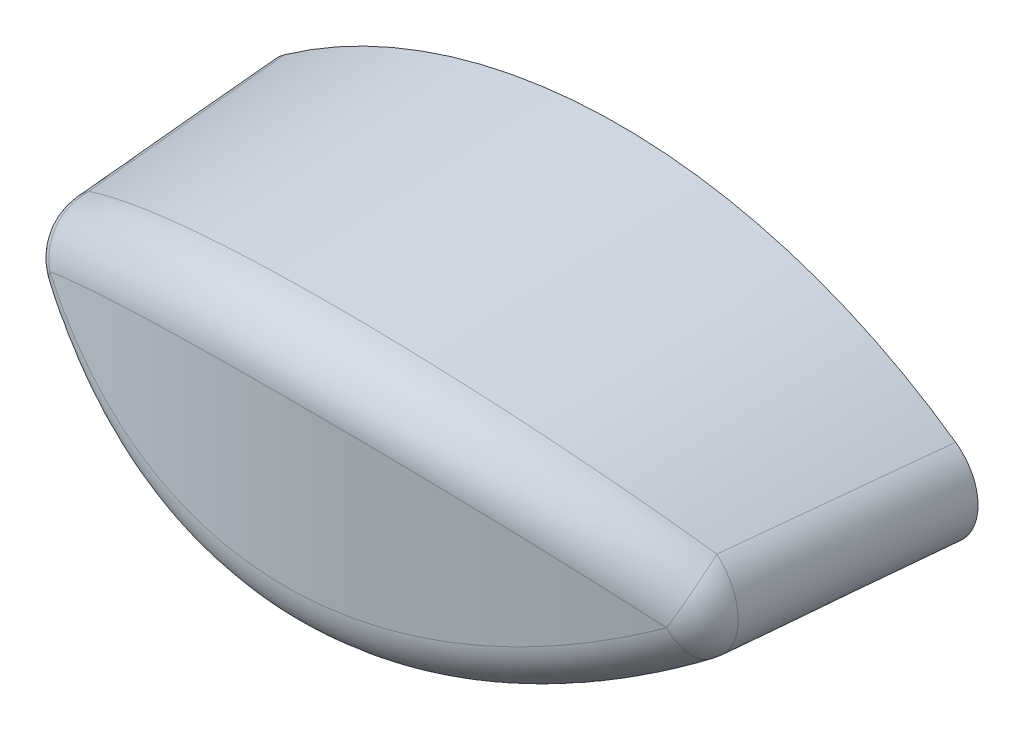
ISO-10303-21;
HEADER;
FILE_DESCRIPTION(('STEP AP214'),'2;1');
FILE_NAME('part.step','',(''),(''),'','','');
FILE_SCHEMA(('AUTOMOTIVE_DESIGN { 1 0 10303 214 1 1 1 1 }'));
ENDSEC;
DATA;
#1=APPLICATION_CONTEXT('core data for automotive mechanical design processes');
#2=APPLICATION_PROTOCOL_DEFINITION('international standard','automotive_design',2000,#1);
#3=PRODUCT_CONTEXT('',#1,'mechanical');
#4=PRODUCT('Part','Part','',(#3));
#5=PRODUCT_RELATED_PRODUCT_CATEGORY('part','',(#4));
#6=PRODUCT_DEFINITION_FORMATION('','',#4);
#7=PRODUCT_DEFINITION_CONTEXT('part definition',#1,'design');
#8=PRODUCT_DEFINITION('design','',#6,#7);
#9=PRODUCT_DEFINITION_SHAPE('','',#8);
#10=(LENGTH_UNIT() NAMED_UNIT(*) SI_UNIT(.MILLI.,.METRE.));
#11=(NAMED_UNIT(*) PLANE_ANGLE_UNIT() SI_UNIT($,.RADIAN.));
#12=(NAMED_UNIT(*) SI_UNIT($,.STERADIAN.) SOLID_ANGLE_UNIT());
#13=UNCERTAINTY_MEASURE_WITH_UNIT(LENGTH_MEASURE(1.E-05),#10,'distance_accuracy_value','');
#14=(GEOMETRIC_REPRESENTATION_CONTEXT(3) GLOBAL_UNCERTAINTY_ASSIGNED_CONTEXT((#13)) GLOBAL_UNIT_ASSIGNED_CONTEXT((#10,
#11,#12)) REPRESENTATION_CONTEXT('',''));
#15=CARTESIAN_POINT('',(0.,0.,0.));
#16=DIRECTION('',(0.,0.,1.));
#17=DIRECTION('',(1.,0.,0.));
#18=AXIS2_PLACEMENT_3D('',#15,#16,#17);
#19=CARTESIAN_POINT('',(-0.0510288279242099,0.,0.4));
#20=DIRECTION('',(0.,0.,1.));
#21=DIRECTION('',(1.,0.,0.));
#22=AXIS2_PLACEMENT_3D('',#19,#20,#21);
#23=PLANE('',#22);
#24=CARTESIAN_POINT('',(-0.0510288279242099,-16.2061475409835,0.4));
#25=DIRECTION('',(0.,0.,1.));
#26=DIRECTION('',(1.,0.,0.));
#27=AXIS2_PLACEMENT_3D('',#24,#25,#26);
#28=CIRCLE('',#27,21.8561475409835);
#29=CARTESIAN_POINT('',(12.5809473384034,1.62989359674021,0.4));
#30=VERTEX_POINT('',#29);
#31=CARTESIAN_POINT('',(-12.6830049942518,1.62989359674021,0.4));
#32=VERTEX_POINT('',#31);
#33=EDGE_CURVE('E80',#30,#32,#28,.T.);
#34=ORIENTED_EDGE('',*,*,#33,.F.);
#35=CARTESIAN_POINT('',(12.5809473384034,1.62989359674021,0.4));
#36=CARTESIAN_POINT('',(12.776164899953,1.49163513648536,0.4));
#37=CARTESIAN_POINT('',(12.9332502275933,1.31152421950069,0.4));
#38=CARTESIAN_POINT('',(13.0909393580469,1.13072099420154,0.4));
#39=CARTESIAN_POINT('',(13.2013077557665,0.917950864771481,0.4));
#40=CARTESIAN_POINT('',(13.3116239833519,0.70528130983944,0.4));
#41=CARTESIAN_POINT('',(13.3684303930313,0.472691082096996,0.4));
#42=CARTESIAN_POINT('',(13.4251012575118,0.240655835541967,0.4));
#43=CARTESIAN_POINT('',(13.4253236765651,0.00185519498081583,0.4));
#44=CARTESIAN_POINT('',(13.4255468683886,-0.237775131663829,0.4));
#45=CARTESIAN_POINT('',(13.3689216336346,-0.470675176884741,0.4));
#46=CARTESIAN_POINT('',(13.3122961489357,-0.703576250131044,0.4));
#47=CARTESIAN_POINT('',(13.202027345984,-0.916562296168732,0.4));
#48=CARTESIAN_POINT('',(13.0922121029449,-1.12867228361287,0.4));
#49=CARTESIAN_POINT('',(12.935366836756,-1.30909341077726,0.4));
#50=CARTESIAN_POINT('',(12.7775001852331,-1.49068945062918,0.4));
#51=CARTESIAN_POINT('',(12.5809473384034,-1.6298935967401,0.4));
#52=B_SPLINE_CURVE_WITH_KNOTS('',2,(#35,#36,#37,#38,#39,#40,#41,#42,#43,#44,#45,#46,#47,#48,#49,
#50,#51),.UNSPECIFIED.,.F.,.F.,(3,2,2,2,2,2,2,2,3),(0.,0.125,0.25,0.375,0.5,0.625,0.75,0.875,
1.),.UNSPECIFIED.);
#53=CARTESIAN_POINT('',(12.5809473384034,-1.6298935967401,0.4));
#54=VERTEX_POINT('',#53);
#55=EDGE_CURVE('E61',#30,#54,#52,.T.);
#56=ORIENTED_EDGE('',*,*,#55,.T.);
#57=CARTESIAN_POINT('',(-0.0510288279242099,16.2061475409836,0.4));
#58=DIRECTION('',(0.,0.,1.));
#59=DIRECTION('',(1.,0.,0.));
#60=AXIS2_PLACEMENT_3D('',#57,#58,#59);
#61=CIRCLE('',#60,21.8561475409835);
#62=CARTESIAN_POINT('',(-12.6830049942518,-1.6298935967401,0.4));
#63=VERTEX_POINT('',#62);
#64=EDGE_CURVE('E90',#63,#54,#61,.T.);
#65=ORIENTED_EDGE('',*,*,#64,.F.);
#66=CARTESIAN_POINT('',(-12.6830049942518,-1.6298935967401,0.4));
#67=CARTESIAN_POINT('',(-12.8782225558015,-1.49163513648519,0.4));
#68=CARTESIAN_POINT('',(-13.0353078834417,-1.31152421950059,0.4));
#69=CARTESIAN_POINT('',(-13.1929970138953,-1.13072099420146,0.4));
#70=CARTESIAN_POINT('',(-13.3033654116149,-0.917950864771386,0.4));
#71=CARTESIAN_POINT('',(-13.4136816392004,-0.70528130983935,0.4));
#72=CARTESIAN_POINT('',(-13.4704880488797,-0.472691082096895,0.4));
#73=CARTESIAN_POINT('',(-13.5271589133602,-0.240655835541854,0.4));
#74=CARTESIAN_POINT('',(-13.5273813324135,-0.00185519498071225,0.4));
#75=CARTESIAN_POINT('',(-13.527604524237,0.237775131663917,0.4));
#76=CARTESIAN_POINT('',(-13.470979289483,0.470675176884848,0.4));
#77=CARTESIAN_POINT('',(-13.4143538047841,0.703576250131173,0.4));
#78=CARTESIAN_POINT('',(-13.3040850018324,0.916562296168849,0.4));
#79=CARTESIAN_POINT('',(-13.1942697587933,1.12867228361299,0.4));
#80=CARTESIAN_POINT('',(-13.0374244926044,1.30909341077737,0.4));
#81=CARTESIAN_POINT('',(-12.8795578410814,1.49068945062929,0.4));
#82=CARTESIAN_POINT('',(-12.6830049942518,1.62989359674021,0.4));
#83=B_SPLINE_CURVE_WITH_KNOTS('',2,(#66,#67,#68,#69,#70,#71,#72,#73,#74,#75,#76,#77,#78,#79,#80,
#81,#82),.UNSPECIFIED.,.F.,.F.,(3,2,2,2,2,2,2,2,3),(0.,0.125,0.25,0.375,0.5,0.625,0.75,0.875,
1.),.UNSPECIFIED.);
#84=EDGE_CURVE('E74',#63,#32,#83,.T.);
#85=ORIENTED_EDGE('',*,*,#84,.T.);
#86=EDGE_LOOP('',(#34,#56,#65,#85));
#87=FACE_BOUND('',#86,.T.);
#88=CARTESIAN_POINT('',(0.,0.,0.4));
#89=DIRECTION('',(0.,0.,1.));
#90=DIRECTION('',(1.,0.,0.));
#91=AXIS2_PLACEMENT_3D('',#88,#89,#90);
#92=CIRCLE('',#91,3.5);
#93=CARTESIAN_POINT('',(3.5,0.,0.4));
#94=VERTEX_POINT('',#93);
#95=EDGE_CURVE('E240',#94,#94,#92,.F.);
#96=ORIENTED_EDGE('',*,*,#95,.F.);
#97=EDGE_LOOP('',(#96));
#98=FACE_BOUND('',#97,.T.);
#99=ADVANCED_FACE('F14',(#87,#98),#23,.F.);
#100=CARTESIAN_POINT('',(-0.0510288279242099,16.2061475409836,0.4));
#101=DIRECTION('',(0.,0.,-1.));
#102=DIRECTION('',(1.,0.,0.));
#103=AXIS2_PLACEMENT_3D('',#100,#101,#102);
#104=CONICAL_SURFACE('',#103,21.8561475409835,0.05235987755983);
#105=ORIENTED_EDGE('',*,*,#64,.T.);
#106=CARTESIAN_POINT('',(7.86483307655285,-1.82885083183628,41.6230985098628));
#107=CARTESIAN_POINT('',(9.04533017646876,-1.30190072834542,41.7770325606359));
#108=CARTESIAN_POINT('',(9.04533017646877,0.,41.7770325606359));
#109=CARTESIAN_POINT('',(9.04533017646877,1.30190072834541,41.7770325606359));
#110=CARTESIAN_POINT('',(7.86483307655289,1.82885083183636,41.6230985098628));
#111=CARTESIAN_POINT('',(7.9749393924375,-1.82467287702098,40.8516166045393));
#112=CARTESIAN_POINT('',(9.14614592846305,-1.29456590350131,41.0038231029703));
#113=CARTESIAN_POINT('',(9.14631175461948,0.,41.0025376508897));
#114=CARTESIAN_POINT('',(9.14614592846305,1.29456590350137,41.0038231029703));
#115=CARTESIAN_POINT('',(7.97493939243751,1.82467287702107,40.8516166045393));
#116=CARTESIAN_POINT('',(8.08304633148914,-1.82052233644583,40.0799101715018));
#117=CARTESIAN_POINT('',(9.24537155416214,-1.28742916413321,40.2292221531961));
#118=CARTESIAN_POINT('',(9.24552499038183,0.,40.2280015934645));
#119=CARTESIAN_POINT('',(9.24537155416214,1.2874291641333,40.2292221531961));
#120=CARTESIAN_POINT('',(8.08304633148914,1.82052233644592,40.0799101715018));
#121=CARTESIAN_POINT('',(8.29566018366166,-1.81227533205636,38.536105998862));
#122=CARTESIAN_POINT('',(9.44062083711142,-1.27353816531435,38.6800722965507));
#123=CARTESIAN_POINT('',(9.44077530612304,0.,38.6788498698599));
#124=CARTESIAN_POINT('',(9.44062083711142,1.27353816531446,38.6800722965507));
#125=CARTESIAN_POINT('',(8.29566018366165,1.81227533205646,38.536105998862));
#126=CARTESIAN_POINT('',(8.4001671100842,-1.80817886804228,37.7640082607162));
#127=CARTESIAN_POINT('',(9.53667200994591,-1.26678146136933,37.905384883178));
#128=CARTESIAN_POINT('',(9.53681239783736,0.,37.9042342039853));
#129=CARTESIAN_POINT('',(9.53667200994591,1.26678146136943,37.905384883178));
#130=CARTESIAN_POINT('',(8.40016711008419,1.80817886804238,37.7640082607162));
#131=CARTESIAN_POINT('',(8.70888367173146,-1.7959695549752,35.4472322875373));
#132=CARTESIAN_POINT('',(9.82013684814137,-1.24705166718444,35.5848814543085));
#133=CARTESIAN_POINT('',(9.82069814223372,0.,35.580289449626));
#134=CARTESIAN_POINT('',(9.82013684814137,1.24705166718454,35.5848814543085));
#135=CARTESIAN_POINT('',(8.70888367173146,1.7959695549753,35.4472322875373));
#136=CARTESIAN_POINT('',(8.90829278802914,-1.78793664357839,33.9020451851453));
#137=CARTESIAN_POINT('',(10.0038468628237,-1.23454783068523,34.0349680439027));
#138=CARTESIAN_POINT('',(10.004324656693,0.,34.0308363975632));
#139=CARTESIAN_POINT('',(10.0038468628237,1.23454783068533,34.0349680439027));
#140=CARTESIAN_POINT('',(8.90829278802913,1.78793664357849,33.9020451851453));
#141=CARTESIAN_POINT('',(9.29664559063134,-1.7720778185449,30.8107112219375));
#142=CARTESIAN_POINT('',(10.36194250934,-1.21065868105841,30.9358151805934));
#143=CARTESIAN_POINT('',(10.3624164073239,0.,30.93171037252));
#144=CARTESIAN_POINT('',(10.36194250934,1.21065868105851,30.9358151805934));
#145=CARTESIAN_POINT('',(9.29664559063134,1.77207781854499,30.8107112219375));
#146=CARTESIAN_POINT('',(9.48558981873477,-1.76425189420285,29.2645644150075));
#147=CARTESIAN_POINT('',(10.5364704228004,-1.19926122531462,29.3857716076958));
#148=CARTESIAN_POINT('',(10.5368821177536,0.,29.3820374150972));
#149=CARTESIAN_POINT('',(10.5364704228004,1.19926122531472,29.3857716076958));
#150=CARTESIAN_POINT('',(9.48558981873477,1.76425189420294,29.2645644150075));
#151=CARTESIAN_POINT('',(9.85472048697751,-1.74879974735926,26.1714328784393));
#152=CARTESIAN_POINT('',(10.8777690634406,-1.177400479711,26.2861154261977));
#153=CARTESIAN_POINT('',(10.8781764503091,0.,26.2824107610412));
#154=CARTESIAN_POINT('',(10.8777690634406,1.17740047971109,26.2861154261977));
#155=CARTESIAN_POINT('',(9.85472048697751,1.74879974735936,26.1714328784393));
#156=CARTESIAN_POINT('',(10.0349068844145,-1.74117352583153,24.6244481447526));
#157=CARTESIAN_POINT('',(11.0446506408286,-1.16692800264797,24.7358302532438));
#158=CARTESIAN_POINT('',(11.0450050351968,0.,24.7324570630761));
#159=CARTESIAN_POINT('',(11.0446506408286,1.16692800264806,24.7358302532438));
#160=CARTESIAN_POINT('',(10.0349068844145,1.74117352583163,24.6244481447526));
#161=CARTESIAN_POINT('',(10.5643170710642,-1.71858612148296,19.9828857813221));
#162=CARTESIAN_POINT('',(11.5343693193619,-1.1367634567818,20.0961426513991));
#163=CARTESIAN_POINT('',(11.5357993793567,0.,20.0826251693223));
#164=CARTESIAN_POINT('',(11.5343693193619,1.1367634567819,20.0961426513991));
#165=CARTESIAN_POINT('',(10.5643170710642,1.71858612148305,19.9828857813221));
#166=CARTESIAN_POINT('',(10.9024415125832,-1.70391414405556,16.887298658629));
#167=CARTESIAN_POINT('',(11.848987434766,-1.11814749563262,16.9938587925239));
#168=CARTESIAN_POINT('',(11.8501195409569,0.,16.982373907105));
#169=CARTESIAN_POINT('',(11.848987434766,1.11814749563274,16.9938587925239));
#170=CARTESIAN_POINT('',(10.9024415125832,1.70391414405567,16.887298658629));
#171=CARTESIAN_POINT('',(11.5564799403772,-1.67528841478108,10.6942176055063));
#172=CARTESIAN_POINT('',(12.4584497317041,-1.08329919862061,10.7923713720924));
#173=CARTESIAN_POINT('',(12.4595603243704,0.,10.7810360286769));
#174=CARTESIAN_POINT('',(12.4584497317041,1.08329919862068,10.7923713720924));
#175=CARTESIAN_POINT('',(11.5564799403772,1.67528841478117,10.6942176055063));
#176=CARTESIAN_POINT('',(11.8723935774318,-1.66133467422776,7.59672364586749));
#177=CARTESIAN_POINT('',(12.7537690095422,-1.06703056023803,7.68977834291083));
#178=CARTESIAN_POINT('',(12.7546806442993,0.,7.67994940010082));
#179=CARTESIAN_POINT('',(12.7537690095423,1.06703056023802,7.68977834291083));
#180=CARTESIAN_POINT('',(11.8723935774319,1.66133467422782,7.59672364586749));
#181=CARTESIAN_POINT('',(12.486723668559,-1.6340977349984,1.40071196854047));
#182=CARTESIAN_POINT('',(13.328944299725,-1.03636002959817,1.48724992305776));
#183=CARTESIAN_POINT('',(13.3298493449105,0.,1.47748830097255));
#184=CARTESIAN_POINT('',(13.328944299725,1.03636002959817,1.48724992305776));
#185=CARTESIAN_POINT('',(12.486723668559,1.63409773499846,1.40071196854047));
#186=CARTESIAN_POINT('',(12.7851421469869,-1.62081445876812,-1.69780558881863));
#187=CARTESIAN_POINT('',(13.6091424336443,-1.02193323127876,-1.61532573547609));
#188=CARTESIAN_POINT('',(13.609899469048,0.,-1.62388609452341));
#189=CARTESIAN_POINT('',(13.6091424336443,1.02193323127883,-1.61532573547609));
#190=CARTESIAN_POINT('',(12.785142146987,1.62081445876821,-1.69780558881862));
#191=CARTESIAN_POINT('',(13.3678854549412,-1.59487115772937,-7.89588290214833));
#192=CARTESIAN_POINT('',(14.1571479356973,-0.99458011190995,-7.81866090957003));
#193=CARTESIAN_POINT('',(14.1578971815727,0.,-7.82715141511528));
#194=CARTESIAN_POINT('',(14.1571479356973,0.994580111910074,-7.81866090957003));
#195=CARTESIAN_POINT('',(13.3678854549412,1.59487115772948,-7.89588290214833));
#196=CARTESIAN_POINT('',(13.6522103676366,-1.58221112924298,-10.99544265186));
#197=CARTESIAN_POINT('',(14.4252090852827,-0.981636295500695,-10.9215353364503));
#198=CARTESIAN_POINT('',(14.4258448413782,0.,-10.9290423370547));
#199=CARTESIAN_POINT('',(14.4252090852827,0.981636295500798,-10.9215353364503));
#200=CARTESIAN_POINT('',(13.6522103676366,1.58221112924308,-10.99544265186));
#201=CARTESIAN_POINT('',(14.209281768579,-1.55747051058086,-17.1957879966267));
#202=CARTESIAN_POINT('',(14.9511863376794,-0.956981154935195,-17.1261585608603));
#203=CARTESIAN_POINT('',(14.9518229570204,0.,-17.1336609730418));
#204=CARTESIAN_POINT('',(14.9511863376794,0.956981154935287,-17.1261585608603));
#205=CARTESIAN_POINT('',(14.209281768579,1.55747051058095,-17.1957879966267));
#206=CARTESIAN_POINT('',(14.4820268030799,-1.54538999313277,-20.2965736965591));
#207=CARTESIAN_POINT('',(15.2092962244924,-0.945257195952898,-20.2296371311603));
#208=CARTESIAN_POINT('',(15.2098521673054,0.,-20.236388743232));
#209=CARTESIAN_POINT('',(15.2092962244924,0.945257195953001,-20.2296371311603));
#210=CARTESIAN_POINT('',(14.4820268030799,1.54538999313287,-20.2965736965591));
#211=CARTESIAN_POINT('',(15.017672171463,-1.52177219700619,-26.4988383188));
#212=CARTESIAN_POINT('',(15.7169540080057,-0.922850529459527,-26.4356588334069));
#213=CARTESIAN_POINT('',(15.7174882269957,0.,-26.442234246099));
#214=CARTESIAN_POINT('',(15.7169540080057,0.922850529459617,-26.4356588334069));
#215=CARTESIAN_POINT('',(15.017672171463,1.52177219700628,-26.4988383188));
#216=CARTESIAN_POINT('',(15.2805724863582,-1.5102349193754,-29.600317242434));
#217=CARTESIAN_POINT('',(15.9666567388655,-0.912158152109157,-29.5396513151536));
#218=CARTESIAN_POINT('',(15.967095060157,0.,-29.5453519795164));
#219=CARTESIAN_POINT('',(15.9666567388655,0.912158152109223,-29.5396513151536));
#220=CARTESIAN_POINT('',(15.2805724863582,1.51023491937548,-29.600317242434));
#221=CARTESIAN_POINT('',(15.5394356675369,-1.49895033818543,-32.7020643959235));
#222=CARTESIAN_POINT('',(16.2132553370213,-0.90187789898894,-32.6486293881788));
#223=CARTESIAN_POINT('',(16.2132553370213,0.,-32.6486293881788));
#224=CARTESIAN_POINT('',(16.2132553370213,0.901877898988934,-32.6486293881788));
#225=CARTESIAN_POINT('',(15.539435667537,1.49895033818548,-32.7020643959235));
#226=(BOUNDED_SURFACE() B_SPLINE_SURFACE(3,2,((#106,#107,#108,#109,#110),(#111,#112,#113,#114,
#115),(#116,#117,#118,#119,#120),(#121,#122,#123,#124,#125),(#126,#127,#128,#129,#130),(#131,
#132,#133,#134,#135),(#136,#137,#138,#139,#140),(#141,#142,#143,#144,#145),(#146,#147,#148,#149,
#150),(#151,#152,#153,#154,#155),(#156,#157,#158,#159,#160),(#161,#162,#163,#164,#165),(#166,
#167,#168,#169,#170),(#171,#172,#173,#174,#175),(#176,#177,#178,#179,#180),(#181,#182,#183,#184,
#185),(#186,#187,#188,#189,#190),(#191,#192,#193,#194,#195),(#196,#197,#198,#199,#200),(#201,
#202,#203,#204,#205),(#206,#207,#208,#209,#210),(#211,#212,#213,#214,#215),(#216,#217,#218,#219,
#220),(#221,#222,#223,#224,#225)),.UNSPECIFIED.,.F.,.F.,.F.) B_SPLINE_SURFACE_WITH_KNOTS((4,2,2,
2,2,2,2,2,2,2,2,4),(3,2,3),(0.,2.3340304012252,4.66805217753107,9.33601675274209,
14.0037394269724,18.6714848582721,28.0057639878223,37.3401898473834,46.6735334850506,
56.0068220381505,65.3412788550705,74.6757536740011),(0.,0.5,1.),
.UNSPECIFIED.) GEOMETRIC_REPRESENTATION_ITEM() RATIONAL_B_SPLINE_SURFACE(((1.,0.838079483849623,
1.,0.838079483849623,1.),(1.,0.839487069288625,1.,0.839487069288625,1.),(1.,0.840852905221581,
1.,0.840852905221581,1.),(1.,0.843509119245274,1.,0.843509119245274,1.),(1.,0.84479949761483,1.,
0.84479949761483,1.),(1.,0.848569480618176,1.,0.848569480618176,1.),(1.,0.85094798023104,1.,
0.85094798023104,1.),(1.,0.855483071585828,1.,0.855483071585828,1.),(1.,0.857639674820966,1.,
0.857639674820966,1.),(1.,0.861766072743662,1.,0.861766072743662,1.),(1.,0.8637358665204,1.,
0.8637358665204,1.),(1.,0.869406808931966,1.,0.869406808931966,1.),(1.,0.872870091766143,1.,
0.872870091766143,1.),(1.,0.879317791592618,1.,0.879317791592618,1.),(1.,0.882302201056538,1.,
0.882302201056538,1.),(1.,0.887893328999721,1.,0.887893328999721,1.),(1.,0.890500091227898,1.,
0.890500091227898,1.),(1.,0.895408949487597,1.,0.895408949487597,1.),(1.,0.89771104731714,1.,
0.89771104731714,1.),(1.,0.902064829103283,1.,0.902064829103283,1.),(1.,0.904116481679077,1.,
0.904116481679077,1.),(1.,0.908007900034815,1.,0.908007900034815,1.),(1.,0.909847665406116,1.,
0.909847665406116,1.),(1.,0.911600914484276,1.,0.911600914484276,1.))) REPRESENTATION_ITEM('') SURFACE());
#227=CARTESIAN_POINT('',(15.5394356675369,-1.49895033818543,-32.7020643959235));
#228=CARTESIAN_POINT('',(15.2805724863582,-1.5102349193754,-29.600317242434));
#229=CARTESIAN_POINT('',(15.017672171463,-1.52177219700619,-26.4988383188));
#230=CARTESIAN_POINT('',(14.4820268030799,-1.54538999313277,-20.2965736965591));
#231=CARTESIAN_POINT('',(14.209281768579,-1.55747051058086,-17.1957879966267));
#232=CARTESIAN_POINT('',(13.6522103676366,-1.58221112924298,-10.99544265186));
#233=CARTESIAN_POINT('',(13.3678854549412,-1.59487115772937,-7.89588290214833));
#234=CARTESIAN_POINT('',(12.7851421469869,-1.62081445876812,-1.69780558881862));
#235=CARTESIAN_POINT('',(12.486723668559,-1.6340977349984,1.40071196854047));
#236=CARTESIAN_POINT('',(11.8723935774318,-1.66133467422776,7.59672364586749));
#237=CARTESIAN_POINT('',(11.5564799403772,-1.67528841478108,10.6942176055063));
#238=CARTESIAN_POINT('',(10.9024415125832,-1.70391414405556,16.887298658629));
#239=CARTESIAN_POINT('',(10.5643170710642,-1.71858612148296,19.9828857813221));
#240=CARTESIAN_POINT('',(10.0349068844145,-1.74117352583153,24.6244481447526));
#241=CARTESIAN_POINT('',(9.85472048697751,-1.74879974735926,26.1714328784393));
#242=CARTESIAN_POINT('',(9.48558981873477,-1.76425189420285,29.2645644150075));
#243=CARTESIAN_POINT('',(9.29664559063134,-1.7720778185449,30.8107112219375));
#244=CARTESIAN_POINT('',(8.90829278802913,-1.78793664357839,33.9020451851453));
#245=CARTESIAN_POINT('',(8.70888367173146,-1.7959695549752,35.4472322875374));
#246=CARTESIAN_POINT('',(8.4001671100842,-1.80817886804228,37.7640082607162));
#247=CARTESIAN_POINT('',(8.29566018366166,-1.81227533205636,38.536105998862));
#248=CARTESIAN_POINT('',(8.08304633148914,-1.82052233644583,40.0799101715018));
#249=CARTESIAN_POINT('',(7.9749393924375,-1.82467287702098,40.8516166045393));
#250=CARTESIAN_POINT('',(7.86483307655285,-1.82885083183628,41.6230985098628));
#251=B_SPLINE_CURVE_WITH_KNOTS('',3,(#227,#228,#229,#230,#231,#232,#233,#234,#235,#236,#237,
#238,#239,#240,#241,#242,#243,#244,#245,#246,#247,#248,#249,#250),.UNSPECIFIED.,.F.,.F.,(4,2,2,
2,2,2,2,2,2,2,2,4),(0.,9.33447481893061,18.6689316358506,28.0022201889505,37.3355638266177,
46.6699896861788,56.004268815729,60.6720142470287,65.339736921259,70.00770149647,
72.3417232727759,74.6757536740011),.UNSPECIFIED.);
#252=CARTESIAN_POINT('',(11.7698764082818,-1.6658422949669,8.57727236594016));
#253=VERTEX_POINT('',#252);
#254=EDGE_CURVE('E67',#54,#253,#251,.T.);
#255=ORIENTED_EDGE('',*,*,#254,.T.);
#256=CARTESIAN_POINT('',(-17.7551582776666,3.79787679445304,4.91612089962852));
#257=CARTESIAN_POINT('',(-17.9950283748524,4.22195077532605,5.8122446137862));
#258=CARTESIAN_POINT('',(-17.4606707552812,4.9441830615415,6.29521104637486));
#259=CARTESIAN_POINT('',(-17.5757015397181,3.55533651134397,5.06386731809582));
#260=CARTESIAN_POINT('',(-17.8248686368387,3.98221385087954,5.9750010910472));
#261=CARTESIAN_POINT('',(-17.2835696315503,4.72445973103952,6.4552834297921));
#262=CARTESIAN_POINT('',(-17.3912028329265,3.31656568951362,5.21163200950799));
#263=CARTESIAN_POINT('',(-17.6501792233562,3.74647291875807,6.13763212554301));
#264=CARTESIAN_POINT('',(-17.1015291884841,4.50818232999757,6.61537561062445));
#265=CARTESIAN_POINT('',(-17.0121013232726,2.84659054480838,5.50648433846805));
#266=CARTESIAN_POINT('',(-17.2906656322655,3.28137370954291,6.4629573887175));
#267=CARTESIAN_POINT('',(-16.7275558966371,4.08253980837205,6.9348264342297));
#268=CARTESIAN_POINT('',(-16.8174979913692,2.61538661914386,5.65357194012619));
#269=CARTESIAN_POINT('',(-17.1057268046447,3.05200572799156,6.62569060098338));
#270=CARTESIAN_POINT('',(-16.5356225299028,3.87317505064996,7.09418503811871));
#271=CARTESIAN_POINT('',(-16.2181787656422,1.93280426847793,6.09298269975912));
#272=CARTESIAN_POINT('',(-16.5330535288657,2.37061821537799,7.1149426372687));
#273=CARTESIAN_POINT('',(-15.9446448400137,3.25515237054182,7.57025429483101));
#274=CARTESIAN_POINT('',(-15.7982691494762,1.49288191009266,6.38319147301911));
#275=CARTESIAN_POINT('',(-16.1312476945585,1.93072224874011,7.43882115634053));
#276=CARTESIAN_POINT('',(-15.5307343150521,2.85695252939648,7.88467416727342));
#277=CARTESIAN_POINT('',(-14.9142510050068,0.641535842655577,6.95493140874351));
#278=CARTESIAN_POINT('',(-15.2818033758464,1.07414986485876,8.08098498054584));
#279=CARTESIAN_POINT('',(-14.6596823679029,2.08654590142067,8.50411235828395));
#280=CARTESIAN_POINT('',(-14.4497747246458,0.230408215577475,7.23635945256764));
#281=CARTESIAN_POINT('',(-14.8329214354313,0.657985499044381,8.39918687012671));
#282=CARTESIAN_POINT('',(-14.2021815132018,1.71460891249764,8.80901895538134));
#283=CARTESIAN_POINT('',(-13.48028860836,-0.556106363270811,7.78227285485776));
#284=CARTESIAN_POINT('',(-13.8909990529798,-0.144056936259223,9.02115639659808));
#285=CARTESIAN_POINT('',(-13.2475976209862,1.00324072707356,9.40047599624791));
#286=CARTESIAN_POINT('',(-12.975297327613,-0.931509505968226,8.04676587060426));
#287=CARTESIAN_POINT('',(-13.3971503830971,-0.529512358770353,9.32474440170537));
#288=CARTESIAN_POINT('',(-12.7505327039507,0.663794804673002,9.6870347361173));
#289=CARTESIAN_POINT('',(-12.0167771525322,-1.58118949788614,8.50942829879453));
#290=CARTESIAN_POINT('',(-12.4549934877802,-1.2013679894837,9.85974235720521));
#291=CARTESIAN_POINT('',(-11.8073628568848,0.0764728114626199,10.1882954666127));
#292=CARTESIAN_POINT('',(-11.5695664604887,-1.86170052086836,8.71113363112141));
#293=CARTESIAN_POINT('',(-12.0121814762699,-1.49370774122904,10.0948899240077));
#294=CARTESIAN_POINT('',(-11.3674238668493,-0.17706286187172,10.40682836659));
#295=CARTESIAN_POINT('',(-10.6487565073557,-2.39351792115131,9.09630245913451));
#296=CARTESIAN_POINT('',(-11.0947124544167,-2.05228118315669,10.5475348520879));
#297=CARTESIAN_POINT('',(-10.4618033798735,-0.65765769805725,10.8241304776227));
#298=CARTESIAN_POINT('',(-10.1751558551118,-2.64482275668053,9.27976499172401));
#299=CARTESIAN_POINT('',(-10.6198865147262,-2.31797793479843,10.764646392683));
#300=CARTESIAN_POINT('',(-9.99612052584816,-0.884715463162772,11.0228986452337));
#301=CARTESIAN_POINT('',(-9.20515901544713,-3.11439986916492,9.6245407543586));
#302=CARTESIAN_POINT('',(-9.64073722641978,-2.81857242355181,11.1761397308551));
#303=CARTESIAN_POINT('',(-9.04254207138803,-1.30892295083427,11.3964378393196));
#304=CARTESIAN_POINT('',(-8.70887150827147,-3.33281172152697,9.78594728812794));
#305=CARTESIAN_POINT('',(-9.13660460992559,-3.05296184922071,11.370126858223));
#306=CARTESIAN_POINT('',(-8.5547524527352,-1.50619905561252,11.5713099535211));
#307=CARTESIAN_POINT('',(-7.6939587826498,-3.73492734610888,10.0844379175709));
#308=CARTESIAN_POINT('',(-8.09826518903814,-3.48816755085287,11.7319946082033));
#309=CARTESIAN_POINT('',(-7.55739754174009,-1.86935648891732,11.8947026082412));
#310=CARTESIAN_POINT('',(-7.17534176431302,-3.91864372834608,10.2215308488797));
#311=CARTESIAN_POINT('',(-7.5644729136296,-3.68825614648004,11.8992918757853));
#312=CARTESIAN_POINT('',(-7.04784024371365,-2.0352492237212,12.0432327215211));
#313=CARTESIAN_POINT('',(-5.9958696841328,-4.28686134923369,10.4972272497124));
#314=CARTESIAN_POINT('',(-6.34042830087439,-4.09311738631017,12.2389949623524));
#315=CARTESIAN_POINT('',(-5.88914321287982,-2.36771007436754,12.3419295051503));
#316=CARTESIAN_POINT('',(-5.32991253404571,-4.46167084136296,10.6288129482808));
#317=CARTESIAN_POINT('',(-5.64581435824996,-4.28630344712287,12.4020051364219));
#318=CARTESIAN_POINT('',(-5.23503012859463,-2.52551898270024,12.4844929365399));
#319=CARTESIAN_POINT('',(-3.97500813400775,-4.74957595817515,10.846100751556));
#320=CARTESIAN_POINT('',(-4.22134443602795,-4.60746782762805,12.6737435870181));
#321=CARTESIAN_POINT('',(-3.90439400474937,-2.78540421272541,12.7199082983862));
#322=CARTESIAN_POINT('',(-3.28604144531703,-4.86261792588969,10.9317629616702));
#323=CARTESIAN_POINT('',(-3.49392801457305,-4.73409920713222,12.7813419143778));
#324=CARTESIAN_POINT('',(-3.227852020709,-2.88743207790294,12.8127170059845));
#325=CARTESIAN_POINT('',(-2.09883364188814,-4.99971900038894,11.0358461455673));
#326=CARTESIAN_POINT('',(-2.2339874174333,-4.88862425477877,12.9128741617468));
#327=CARTESIAN_POINT('',(-2.06213708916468,-3.01117016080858,12.9254834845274));
#328=CARTESIAN_POINT('',(-1.60371933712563,-5.04013076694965,11.0666037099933));
#329=CARTESIAN_POINT('',(-1.70730323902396,-4.93428586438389,12.9518379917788));
#330=CARTESIAN_POINT('',(-1.57601030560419,-3.04764111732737,12.9588070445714));
#331=CARTESIAN_POINT('',(-0.610608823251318,-5.08753786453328,11.1027911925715));
#332=CARTESIAN_POINT('',(-0.648361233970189,-4.98800979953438,12.9977988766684));
#333=CARTESIAN_POINT('',(-0.600947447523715,-3.09042452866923,12.9980135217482));
#334=CARTESIAN_POINT('',(-0.112612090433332,-5.09452691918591,11.1082163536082));
#335=CARTESIAN_POINT('',(-0.117379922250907,-4.99593457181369,13.0046786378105));
#336=CARTESIAN_POINT('',(-0.112010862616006,-3.09673131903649,13.0038912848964));
#337=CARTESIAN_POINT('',(0.882220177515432,-5.07493082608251,11.0935970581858));
#338=CARTESIAN_POINT('',(0.944140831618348,-4.9737427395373,12.9860646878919));
#339=CARTESIAN_POINT('',(0.864730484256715,-3.07904495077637,12.9880523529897));
#340=CARTESIAN_POINT('',(1.37905576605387,-5.04834725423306,11.0735537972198));
#341=CARTESIAN_POINT('',(1.47337988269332,-4.94368204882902,12.9606182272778));
#342=CARTESIAN_POINT('',(1.35253529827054,-3.05505321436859,12.9663369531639));
#343=CARTESIAN_POINT('',(2.36777929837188,-4.96206948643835,11.0084300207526));
#344=CARTESIAN_POINT('',(2.52565944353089,-4.84617630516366,12.8780198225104));
#345=CARTESIAN_POINT('',(2.32332354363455,-2.9771848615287,12.8957801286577));
#346=CARTESIAN_POINT('',(2.85966746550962,-4.90237679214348,10.9633506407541));
#347=CARTESIAN_POINT('',(3.04748051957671,-4.77896365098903,12.8210648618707));
#348=CARTESIAN_POINT('',(2.80630719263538,-2.92330960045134,12.8469399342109));
#349=CARTESIAN_POINT('',(3.83311199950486,-4.75115025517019,10.8492951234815));
#350=CARTESIAN_POINT('',(4.07770880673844,-4.60908100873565,12.6773263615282));
#351=CARTESIAN_POINT('',(3.76219237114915,-2.78681275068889,12.7233691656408));
#352=CARTESIAN_POINT('',(4.31470040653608,-4.65973769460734,10.7804100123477));
#353=CARTESIAN_POINT('',(4.58510556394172,-4.50691831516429,12.5909704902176));
#354=CARTESIAN_POINT('',(4.2351251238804,-2.70430065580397,12.6487372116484));
#355=CARTESIAN_POINT('',(5.26634785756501,-4.44642254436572,10.6200366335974));
#356=CARTESIAN_POINT('',(5.58411863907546,-4.26939971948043,12.390707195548));
#357=CARTESIAN_POINT('',(5.16975446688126,-2.51173922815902,12.474984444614));
#358=CARTESIAN_POINT('',(5.73640658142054,-4.32451910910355,10.5285477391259));
#359=CARTESIAN_POINT('',(6.07491203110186,-4.13450586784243,12.277186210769));
#360=CARTESIAN_POINT('',(5.6314507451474,-2.40168913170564,12.3758629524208));
#361=CARTESIAN_POINT('',(6.66324340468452,-4.05165574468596,10.324413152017));
#362=CARTESIAN_POINT('',(7.03822137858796,-3.83399610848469,12.0251491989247));
#363=CARTESIAN_POINT('',(6.54190567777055,-2.15533256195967,12.1546981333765));
#364=CARTESIAN_POINT('',(7.11999390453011,-3.90063977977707,10.2117266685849));
#365=CARTESIAN_POINT('',(7.51012235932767,-3.66882497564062,11.8870008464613));
#366=CARTESIAN_POINT('',(6.99063743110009,-2.01897545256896,12.0326106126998));
#367=CARTESIAN_POINT('',(8.01717596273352,-3.57156470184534,9.96716736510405));
#368=CARTESIAN_POINT('',(8.43228339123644,-3.31085520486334,11.5888829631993));
#369=CARTESIAN_POINT('',(7.87219289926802,-1.72180732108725,11.7676485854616));
#370=CARTESIAN_POINT('',(8.45760541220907,-3.39350210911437,9.83529207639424));
#371=CARTESIAN_POINT('',(8.88218741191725,-3.118554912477,11.4293165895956));
#372=CARTESIAN_POINT('',(8.30501455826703,-1.56099315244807,11.6247714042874));
#373=CARTESIAN_POINT('',(9.34545465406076,-3.00122745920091,9.54621055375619));
#374=CARTESIAN_POINT('',(9.7839115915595,-2.69749283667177,11.0817604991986));
#375=CARTESIAN_POINT('',(9.17766986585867,-1.20666862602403,11.3115728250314));
#376=CARTESIAN_POINT('',(9.79180213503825,-2.78551909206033,9.38797963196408));
#377=CARTESIAN_POINT('',(10.2344694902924,-2.46765297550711,10.8929593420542));
#378=CARTESIAN_POINT('',(9.61645797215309,-1.01180409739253,11.1401412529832));
#379=CARTESIAN_POINT('',(10.6630493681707,-2.32816868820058,9.05465039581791));
#380=CARTESIAN_POINT('',(11.1088433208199,-1.98334217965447,10.4978117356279));
#381=CARTESIAN_POINT('',(10.4731167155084,-0.598580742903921,10.779003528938));
#382=CARTESIAN_POINT('',(11.0879438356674,-2.08652030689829,8.87954795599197));
#383=CARTESIAN_POINT('',(11.5326830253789,-1.72933360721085,10.2918117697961));
#384=CARTESIAN_POINT('',(10.8909821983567,-0.380216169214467,10.5892929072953));
#385=CARTESIAN_POINT('',(11.9130189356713,-1.58076055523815,8.51589698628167));
#386=CARTESIAN_POINT('',(12.351144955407,-1.20086504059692,9.86668577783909));
#387=CARTESIAN_POINT('',(11.7025834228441,0.0768917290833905,10.1953038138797));
#388=CARTESIAN_POINT('',(12.3133199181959,-1.31677664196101,8.32742562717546));
#389=CARTESIAN_POINT('',(12.7460647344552,-0.92691177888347,9.6479082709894));
#390=CARTESIAN_POINT('',(12.0964365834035,0.315519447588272,9.99110895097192));
#391=CARTESIAN_POINT('',(13.0908768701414,-0.767176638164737,7.93869288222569));
#392=CARTESIAN_POINT('',(13.5090468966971,-0.359846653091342,9.19945024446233));
#393=CARTESIAN_POINT('',(12.8616468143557,0.812421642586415,9.56994559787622));
#394=CARTESIAN_POINT('',(13.4681498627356,-0.481576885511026,7.73844042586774));
#395=CARTESIAN_POINT('',(13.8774076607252,-0.0670320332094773,8.96994843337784));
#396=CARTESIAN_POINT('',(13.2330205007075,1.07068128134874,9.35298678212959));
#397=CARTESIAN_POINT('',(13.8338135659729,-0.185937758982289,7.53339361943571));
#398=CARTESIAN_POINT('',(14.2350921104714,0.2364727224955,8.73471849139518));
#399=CARTESIAN_POINT('',(13.5930577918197,1.3380721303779,9.13083364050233));
#400=(BOUNDED_SURFACE() B_SPLINE_SURFACE(3,2,((#256,#257,#258),(#259,#260,#261),(#262,#263,
#264),(#265,#266,#267),(#268,#269,#270),(#271,#272,#273),(#274,#275,#276),(#277,#278,#279),
(#280,#281,#282),(#283,#284,#285),(#286,#287,#288),(#289,#290,#291),(#292,#293,#294),(#295,#296,
#297),(#298,#299,#300),(#301,#302,#303),(#304,#305,#306),(#307,#308,#309),(#310,#311,#312),
(#313,#314,#315),(#316,#317,#318),(#319,#320,#321),(#322,#323,#324),(#325,#326,#327),(#328,#329,
#330),(#331,#332,#333),(#334,#335,#336),(#337,#338,#339),(#340,#341,#342),(#343,#344,#345),
(#346,#347,#348),(#349,#350,#351),(#352,#353,#354),(#355,#356,#357),(#358,#359,#360),(#361,#362,
#363),(#364,#365,#366),(#367,#368,#369),(#370,#371,#372),(#373,#374,#375),(#376,#377,#378),
(#379,#380,#381),(#382,#383,#384),(#385,#386,#387),(#388,#389,#390),(#391,#392,#393),(#394,#395,
#396),(#397,#398,#399)),.UNSPECIFIED.,.F.,.F.,.F.) B_SPLINE_SURFACE_WITH_KNOTS((4,2,2,2,2,2,2,2,
2,2,2,2,2,2,2,2,2,2,2,2,2,2,2,4),(3,3),(0.,0.933402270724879,1.86685346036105,3.73539715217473,
5.62096067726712,7.50566552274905,9.06268146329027,10.6197795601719,12.1700720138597,
13.7197999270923,15.6287982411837,17.5394522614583,18.8915223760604,20.2438463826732,
21.5961069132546,22.9483061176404,24.2953910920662,25.6425134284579,26.9922550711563,
28.3421705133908,29.7702629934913,31.1987055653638,32.619485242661,34.0392015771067),(0.,1.),
.UNSPECIFIED.) GEOMETRIC_REPRESENTATION_ITEM() RATIONAL_B_SPLINE_SURFACE(((1.,0.890834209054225,
1.),(1.,0.887855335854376,1.),(1.,0.884817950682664,1.),(1.,0.878639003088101,1.),(1.,
0.875497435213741,1.),(1.,0.865930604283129,1.),(1.,0.859368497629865,1.),(1.,0.845952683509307,
1.),(1.,0.839096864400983,1.),(1.,0.825320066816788,1.),(1.,0.818399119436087,1.),(1.,
0.80589121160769,1.),(1.,0.800281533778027,1.),(1.,0.789299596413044,1.),(1.,0.783927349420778,
1.),(1.,0.773603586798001,1.),(1.,0.768650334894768,1.),(1.,0.759312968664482,1.),(1.,
0.754928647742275,1.),(1.,0.745973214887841,1.),(1.,0.741594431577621,1.),(1.,0.734274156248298,
1.),(1.,0.731333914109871,1.),(1.,0.727742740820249,1.),(1.,0.726673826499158,1.),(1.,
0.72541687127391,1.),(1.,0.725228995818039,1.),(1.,0.725743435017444,1.),(1.,0.726445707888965,
1.),(1.,0.728709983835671,1.),(1.,0.730271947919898,1.),(1.,0.734183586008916,1.),(1.,
0.736530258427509,1.),(1.,0.741922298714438,1.),(1.,0.74496768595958,1.),(1.,0.75165595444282,
1.),(1.,0.755299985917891,1.),(1.,0.76306558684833,1.),(1.,0.767187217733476,1.),(1.,
0.776040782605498,1.),(1.,0.780794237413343,1.),(1.,0.790576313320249,1.),(1.,0.795605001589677,
1.),(1.,0.805790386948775,1.),(1.,0.810946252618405,1.),(1.,0.821308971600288,1.),(1.,
0.826515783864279,1.),(1.,0.831700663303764,1.))) REPRESENTATION_ITEM('') SURFACE());
#401=CARTESIAN_POINT('',(13.8338135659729,-0.185937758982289,7.53339361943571));
#402=CARTESIAN_POINT('',(13.4681498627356,-0.481576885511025,7.73844042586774));
#403=CARTESIAN_POINT('',(13.0908768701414,-0.767176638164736,7.93869288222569));
#404=CARTESIAN_POINT('',(12.3133199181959,-1.31677664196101,8.32742562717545));
#405=CARTESIAN_POINT('',(11.9130189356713,-1.58076055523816,8.51589698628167));
#406=CARTESIAN_POINT('',(11.0879438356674,-2.08652030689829,8.87954795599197));
#407=CARTESIAN_POINT('',(10.6630493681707,-2.32816868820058,9.05465039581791));
#408=CARTESIAN_POINT('',(9.79180213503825,-2.78551909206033,9.38797963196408));
#409=CARTESIAN_POINT('',(9.34545465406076,-3.00122745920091,9.54621055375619));
#410=CARTESIAN_POINT('',(8.45760541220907,-3.39350210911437,9.83529207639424));
#411=CARTESIAN_POINT('',(8.01717596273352,-3.57156470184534,9.96716736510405));
#412=CARTESIAN_POINT('',(7.11999390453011,-3.90063977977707,10.2117266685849));
#413=CARTESIAN_POINT('',(6.66324340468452,-4.05165574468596,10.324413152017));
#414=CARTESIAN_POINT('',(5.73640658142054,-4.32451910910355,10.5285477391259));
#415=CARTESIAN_POINT('',(5.26634785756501,-4.44642254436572,10.6200366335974));
#416=CARTESIAN_POINT('',(4.31470040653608,-4.65973769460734,10.7804100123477));
#417=CARTESIAN_POINT('',(3.83311199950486,-4.75115025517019,10.8492951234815));
#418=CARTESIAN_POINT('',(2.85966746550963,-4.90237679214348,10.9633506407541));
#419=CARTESIAN_POINT('',(2.36777929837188,-4.96206948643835,11.0084300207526));
#420=CARTESIAN_POINT('',(1.37905576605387,-5.04834725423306,11.0735537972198));
#421=CARTESIAN_POINT('',(0.882220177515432,-5.07493082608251,11.0935970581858));
#422=CARTESIAN_POINT('',(-0.112612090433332,-5.09452691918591,11.1082163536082));
#423=CARTESIAN_POINT('',(-0.610608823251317,-5.08753786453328,11.1027911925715));
#424=CARTESIAN_POINT('',(-1.60371933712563,-5.04013076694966,11.0666037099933));
#425=CARTESIAN_POINT('',(-2.09883364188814,-4.99971900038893,11.0358461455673));
#426=CARTESIAN_POINT('',(-3.28604144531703,-4.86261792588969,10.9317629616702));
#427=CARTESIAN_POINT('',(-3.97500813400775,-4.74957595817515,10.846100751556));
#428=CARTESIAN_POINT('',(-5.32991253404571,-4.46167084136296,10.6288129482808));
#429=CARTESIAN_POINT('',(-5.9958696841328,-4.28686134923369,10.4972272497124));
#430=CARTESIAN_POINT('',(-7.17534176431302,-3.91864372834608,10.2215308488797));
#431=CARTESIAN_POINT('',(-7.6939587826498,-3.73492734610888,10.0844379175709));
#432=CARTESIAN_POINT('',(-8.70887150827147,-3.33281172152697,9.78594728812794));
#433=CARTESIAN_POINT('',(-9.20515901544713,-3.11439986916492,9.6245407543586));
#434=CARTESIAN_POINT('',(-10.1751558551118,-2.64482275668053,9.27976499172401));
#435=CARTESIAN_POINT('',(-10.6487565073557,-2.39351792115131,9.09630245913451));
#436=CARTESIAN_POINT('',(-11.5695664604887,-1.86170052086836,8.71113363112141));
#437=CARTESIAN_POINT('',(-12.0167771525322,-1.58118949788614,8.50942829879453));
#438=CARTESIAN_POINT('',(-12.975297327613,-0.931509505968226,8.04676587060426));
#439=CARTESIAN_POINT('',(-13.48028860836,-0.556106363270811,7.78227285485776));
#440=CARTESIAN_POINT('',(-14.4497747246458,0.230408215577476,7.23635945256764));
#441=CARTESIAN_POINT('',(-14.9142510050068,0.641535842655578,6.95493140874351));
#442=CARTESIAN_POINT('',(-15.7982691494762,1.49288191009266,6.38319147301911));
#443=CARTESIAN_POINT('',(-16.2181787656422,1.93280426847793,6.09298269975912));
#444=CARTESIAN_POINT('',(-16.8174979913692,2.61538661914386,5.65357194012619));
#445=CARTESIAN_POINT('',(-17.0121013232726,2.84659054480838,5.50648433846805));
#446=CARTESIAN_POINT('',(-17.3912028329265,3.31656568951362,5.21163200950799));
#447=CARTESIAN_POINT('',(-17.5757015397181,3.55533651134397,5.06386731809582));
#448=CARTESIAN_POINT('',(-17.7551582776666,3.79787679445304,4.91612089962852));
#449=B_SPLINE_CURVE_WITH_KNOTS('',3,(#401,#402,#403,#404,#405,#406,#407,#408,#409,#410,#411,
#412,#413,#414,#415,#416,#417,#418,#419,#420,#421,#422,#423,#424,#425,#426,#427,#428,#429,#430,
#431,#432,#433,#434,#435,#436,#437,#438,#439,#440,#441,#442,#443,#444,#445,#446,#447,#448),
.UNSPECIFIED.,.F.,.F.,(4,2,2,2,2,2,2,2,2,2,2,2,2,2,2,2,2,2,2,2,2,2,2,4),(0.,1.41971633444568,
2.84049601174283,4.26893858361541,5.69703106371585,7.04694650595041,8.3966881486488,
9.7438104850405,11.0908954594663,12.4430946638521,13.7953551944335,15.1476792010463,
16.4997493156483,18.410403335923,20.3194016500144,21.869129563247,23.4194220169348,
24.9765201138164,26.5335360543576,28.4182408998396,30.303804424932,32.1723481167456,
33.1057993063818,34.0392015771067),.UNSPECIFIED.);
#450=CARTESIAN_POINT('',(-11.8725973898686,-1.6658130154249,8.57075574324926));
#451=VERTEX_POINT('',#450);
#452=EDGE_CURVE('E73',#253,#451,#449,.T.);
#453=ORIENTED_EDGE('',*,*,#452,.T.);
#454=CARTESIAN_POINT('',(-7.96742560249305,1.82883053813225,41.6193511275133));
#455=CARTESIAN_POINT('',(-9.14787837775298,1.30186503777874,41.7732705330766));
#456=CARTESIAN_POINT('',(-9.14787837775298,0.,41.7732705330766));
#457=CARTESIAN_POINT('',(-9.14787837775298,-1.30186503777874,41.7732705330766));
#458=CARTESIAN_POINT('',(-7.96742560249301,-1.82883053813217,41.6193511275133));
#459=CARTESIAN_POINT('',(-8.07752658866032,1.82465262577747,40.84785994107));
#460=CARTESIAN_POINT('',(-9.24868947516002,1.29453082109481,41.0000522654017));
#461=CARTESIAN_POINT('',(-9.24885527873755,0.,40.9987669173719));
#462=CARTESIAN_POINT('',(-9.24868947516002,-1.29453082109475,41.0000522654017));
#463=CARTESIAN_POINT('',(-8.0775265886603,-1.82465262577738,40.84785994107));
#464=CARTESIAN_POINT('',(-8.18562854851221,1.82050212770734,40.0761442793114));
#465=CARTESIAN_POINT('',(-9.34791074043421,1.28739465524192,40.225442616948));
#466=CARTESIAN_POINT('',(-9.34806415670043,0.,40.2242221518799));
#467=CARTESIAN_POINT('',(-9.34791074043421,-1.28739465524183,40.225442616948));
#468=CARTESIAN_POINT('',(-8.18562854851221,-1.82050212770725,40.0761442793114));
#469=CARTESIAN_POINT('',(-8.39823303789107,1.81225520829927,38.532321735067));
#470=CARTESIAN_POINT('',(-9.54315184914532,1.27350474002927,38.6762753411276));
#471=CARTESIAN_POINT('',(-9.54330629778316,0.,38.675053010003));
#472=CARTESIAN_POINT('',(-9.54315184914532,-1.27350474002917,38.6762753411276));
#473=CARTESIAN_POINT('',(-8.39823303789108,-1.81225520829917,38.532321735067));
#474=CARTESIAN_POINT('',(-8.50273558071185,1.80815878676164,37.7602148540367));
#475=CARTESIAN_POINT('',(-9.63919920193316,1.26674854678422,37.9015792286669));
#476=CARTESIAN_POINT('',(-9.6393395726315,0.,37.9004286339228));
#477=CARTESIAN_POINT('',(-9.63919920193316,-1.26674854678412,37.9015792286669));
#478=CARTESIAN_POINT('',(-8.50273558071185,-1.80815878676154,37.7602148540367));
#479=CARTESIAN_POINT('',(-8.81143972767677,1.79594960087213,35.4434115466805));
#480=CARTESIAN_POINT('',(-9.92265330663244,1.24702020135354,35.5810494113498));
#481=CARTESIAN_POINT('',(-9.92321453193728,0.,35.5764577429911));
#482=CARTESIAN_POINT('',(-9.92265330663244,-1.24702020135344,35.5810494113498));
#483=CARTESIAN_POINT('',(-8.81143972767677,-1.79594960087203,35.4434115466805));
#484=CARTESIAN_POINT('',(-9.01084154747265,1.78791677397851,33.8982063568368));
#485=CARTESIAN_POINT('',(-10.1063570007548,1.23451723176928,34.0311186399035));
#486=CARTESIAN_POINT('',(-10.1068347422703,0.,34.0269872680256));
#487=CARTESIAN_POINT('',(-10.1063570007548,-1.23451723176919,34.0311186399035));
#488=CARTESIAN_POINT('',(-9.01084154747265,-1.78791677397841,33.8982063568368));
#489=CARTESIAN_POINT('',(-9.39918117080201,1.77205811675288,30.8068363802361));
#490=CARTESIAN_POINT('',(-10.4644413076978,1.21062966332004,30.9319309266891));
#491=CARTESIAN_POINT('',(-10.4649151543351,0.,30.9278263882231));
#492=CARTESIAN_POINT('',(-10.4644413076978,-1.21062966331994,30.9319309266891));
#493=CARTESIAN_POINT('',(-9.39918117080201,-1.77205811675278,30.8068363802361));
#494=CARTESIAN_POINT('',(-9.5881195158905,1.76423227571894,29.2606716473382));
#495=CARTESIAN_POINT('',(-10.6389641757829,1.19923292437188,29.3818699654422));
#496=CARTESIAN_POINT('',(-10.6393758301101,0.,29.378135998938));
#497=CARTESIAN_POINT('',(-10.6389641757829,-1.19923292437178,29.3818699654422));
#498=CARTESIAN_POINT('',(-9.5881195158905,-1.76423227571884,29.2606716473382));
#499=CARTESIAN_POINT('',(-9.95723947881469,1.74878029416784,26.1675043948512));
#500=CARTESIAN_POINT('',(-10.9802536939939,1.17737349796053,26.2821789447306));
#501=CARTESIAN_POINT('',(-10.9806610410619,0.,26.2784745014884));
#502=CARTESIAN_POINT('',(-10.9802536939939,-1.17737349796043,26.2821789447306));
#503=CARTESIAN_POINT('',(-9.95723947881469,-1.74878029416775,26.1675043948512));
#504=CARTESIAN_POINT('',(-10.1374210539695,1.74115415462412,24.6205018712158));
#505=CARTESIAN_POINT('',(-11.1471311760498,1.16690162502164,24.7318763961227));
#506=CARTESIAN_POINT('',(-11.1474855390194,0.,24.7285033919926));
#507=CARTESIAN_POINT('',(-11.1471311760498,-1.16690162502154,24.7318763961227));
#508=CARTESIAN_POINT('',(-10.1374210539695,-1.74115415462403,24.6205018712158));
#509=CARTESIAN_POINT('',(-10.6668179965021,1.71856699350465,19.9788861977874));
#510=CARTESIAN_POINT('',(-11.6368387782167,1.13673875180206,20.0921359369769));
#511=CARTESIAN_POINT('',(-11.6382687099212,0.,20.0786192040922));
#512=CARTESIAN_POINT('',(-11.6368387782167,-1.13673875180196,20.0921359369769));
#513=CARTESIAN_POINT('',(-10.6668179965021,-1.71856699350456,19.9788861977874));
#514=CARTESIAN_POINT('',(-11.00493522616,1.70389517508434,16.8832637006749));
#515=CARTESIAN_POINT('',(-11.9514508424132,1.11812374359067,16.9898174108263));
#516=CARTESIAN_POINT('',(-11.9525828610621,0.,16.9783330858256));
#517=CARTESIAN_POINT('',(-11.9514508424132,-1.11812374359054,16.9898174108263));
#518=CARTESIAN_POINT('',(-11.0049352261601,-1.70389517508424,16.8832637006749));
#519=CARTESIAN_POINT('',(-11.6589612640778,1.67526975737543,10.6901121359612));
#520=CARTESIAN_POINT('',(-12.560902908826,1.08327712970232,10.7882603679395));
#521=CARTESIAN_POINT('',(-12.5620134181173,0.,10.7769255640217));
#522=CARTESIAN_POINT('',(-12.560902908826,-1.08327712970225,10.7882603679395));
#523=CARTESIAN_POINT('',(-11.6589612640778,-1.67526975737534,10.6901121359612));
#524=CARTESIAN_POINT('',(-11.9748697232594,1.66131616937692,7.59258303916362));
#525=CARTESIAN_POINT('',(-12.8562179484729,1.06700922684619,7.68563266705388));
#526=CARTESIAN_POINT('',(-12.8571295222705,0.,7.67580414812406));
#527=CARTESIAN_POINT('',(-12.8562179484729,-1.0670092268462,7.68563266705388));
#528=CARTESIAN_POINT('',(-11.9748697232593,-1.66131616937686,7.59258303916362));
#529=CARTESIAN_POINT('',(-12.5891908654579,1.63407952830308,1.39650113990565));
#530=CARTESIAN_POINT('',(-13.4313860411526,1.03634001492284,1.48303463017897));
#531=CARTESIAN_POINT('',(-13.4322910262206,0.,1.47327342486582));
#532=CARTESIAN_POINT('',(-13.4313860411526,-1.03634001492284,1.48303463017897));
#533=CARTESIAN_POINT('',(-12.5891908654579,-1.63407952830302,1.39650113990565));
#534=CARTESIAN_POINT('',(-12.8876055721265,1.62079639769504,-1.70205150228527));
#535=CARTESIAN_POINT('',(-13.7115811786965,1.02191380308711,-1.61957578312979));
#536=CARTESIAN_POINT('',(-13.7123381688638,0.,-1.62813580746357));
#537=CARTESIAN_POINT('',(-13.7115811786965,-1.02191380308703,-1.61957578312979));
#538=CARTESIAN_POINT('',(-12.8876055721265,-1.62079639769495,-1.70205150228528));
#539=CARTESIAN_POINT('',(-13.4703423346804,1.59485338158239,-7.90019889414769));
#540=CARTESIAN_POINT('',(-14.2595815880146,0.994561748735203,-7.82298059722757));
#541=CARTESIAN_POINT('',(-14.2603307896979,0.,-7.83147077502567));
#542=CARTESIAN_POINT('',(-14.2595815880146,-0.994561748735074,-7.82298059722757));
#543=CARTESIAN_POINT('',(-13.4703423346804,-1.59485338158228,-7.90019889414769));
#544=CARTESIAN_POINT('',(-13.7546644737,1.5821934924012,-10.999793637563));
#545=CARTESIAN_POINT('',(-14.5276406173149,0.981618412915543,-10.9258897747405));
#546=CARTESIAN_POINT('',(-14.5282763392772,0.,-10.9333965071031));
#547=CARTESIAN_POINT('',(-14.5276406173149,-0.981618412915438,-10.9258897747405));
#548=CARTESIAN_POINT('',(-13.7546644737,-1.5821934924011,-10.999793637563));
#549=CARTESIAN_POINT('',(-14.3117310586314,1.55745314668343,-17.2002088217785));
#550=CARTESIAN_POINT('',(-15.0536142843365,0.956964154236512,-17.1305825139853));
#551=CARTESIAN_POINT('',(-15.054250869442,0.,-17.1380846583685));
#552=CARTESIAN_POINT('',(-15.0536142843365,-0.956964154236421,-17.1305825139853));
#553=CARTESIAN_POINT('',(-14.3117310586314,-1.55745314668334,-17.2002088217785));
#554=CARTESIAN_POINT('',(-14.5844740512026,1.54537276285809,-20.3010293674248));
#555=CARTESIAN_POINT('',(-15.3117226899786,0.945240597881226,-20.2340957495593));
#556=CARTESIAN_POINT('',(-15.3122786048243,0.,-20.2408471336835));
#557=CARTESIAN_POINT('',(-15.3117226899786,-0.945240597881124,-20.2340957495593));
#558=CARTESIAN_POINT('',(-14.5844740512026,-1.54537276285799,-20.3010293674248));
#559=CARTESIAN_POINT('',(-15.1201159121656,1.52175522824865,-26.5033636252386));
#560=CARTESIAN_POINT('',(-15.8193780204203,0.922834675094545,-26.4401868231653));
#561=CARTESIAN_POINT('',(-15.8199122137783,0.,-26.4467620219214));
#562=CARTESIAN_POINT('',(-15.8193780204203,-0.922834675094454,-26.4401868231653));
#563=CARTESIAN_POINT('',(-15.1201159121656,-1.52175522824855,-26.5033636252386));
#564=CARTESIAN_POINT('',(-15.383014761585,1.51021807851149,-29.6048773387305));
#565=CARTESIAN_POINT('',(-16.0690797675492,0.912142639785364,-29.5442139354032));
#566=CARTESIAN_POINT('',(-16.0695180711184,0.,-29.5499144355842));
#567=CARTESIAN_POINT('',(-16.0690797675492,-0.912142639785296,-29.5442139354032));
#568=CARTESIAN_POINT('',(-15.383014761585,-1.51021807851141,-29.6048773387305));
#569=CARTESIAN_POINT('',(-15.6418766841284,1.49893362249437,-32.706659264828));
#570=CARTESIAN_POINT('',(-16.3156775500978,0.901862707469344,-32.6532265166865));
#571=CARTESIAN_POINT('',(-16.3156775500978,0.,-32.6532265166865));
#572=CARTESIAN_POINT('',(-16.3156775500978,-0.90186270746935,-32.6532265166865));
#573=CARTESIAN_POINT('',(-15.6418766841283,-1.49893362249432,-32.706659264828));
#574=(BOUNDED_SURFACE() B_SPLINE_SURFACE(3,2,((#454,#455,#456,#457,#458),(#459,#460,#461,#462,
#463),(#464,#465,#466,#467,#468),(#469,#470,#471,#472,#473),(#474,#475,#476,#477,#478),(#479,
#480,#481,#482,#483),(#484,#485,#486,#487,#488),(#489,#490,#491,#492,#493),(#494,#495,#496,#497,
#498),(#499,#500,#501,#502,#503),(#504,#505,#506,#507,#508),(#509,#510,#511,#512,#513),(#514,
#515,#516,#517,#518),(#519,#520,#521,#522,#523),(#524,#525,#526,#527,#528),(#529,#530,#531,#532,
#533),(#534,#535,#536,#537,#538),(#539,#540,#541,#542,#543),(#544,#545,#546,#547,#548),(#549,
#550,#551,#552,#553),(#554,#555,#556,#557,#558),(#559,#560,#561,#562,#563),(#564,#565,#566,#567,
#568),(#569,#570,#571,#572,#573)),.UNSPECIFIED.,.F.,.F.,.F.) B_SPLINE_SURFACE_WITH_KNOTS((4,2,2,
2,2,2,2,2,2,2,2,4),(3,2,3),(0.,2.33405623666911,4.6681038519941,9.33612013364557,
14.0038945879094,18.6716917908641,28.0060747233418,37.3406043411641,46.6740520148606,
56.0074446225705,65.3420052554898,74.6765838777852),(0.,0.5,1.),
.UNSPECIFIED.) GEOMETRIC_REPRESENTATION_ITEM() RATIONAL_B_SPLINE_SURFACE(((1.,0.838086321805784,
1.,0.838086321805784,1.),(1.,0.839493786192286,1.,0.839493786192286,1.),(1.,0.840859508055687,
1.,0.840859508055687,1.),(1.,0.843515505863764,1.,0.843515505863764,1.),(1.,0.844805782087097,
1.,0.844805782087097,1.),(1.,0.848575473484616,1.,0.848575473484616,1.),(1.,0.850953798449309,
1.,0.850953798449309,1.),(1.,0.855488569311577,1.,0.855488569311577,1.),(1.,0.857645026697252,
1.,0.857645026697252,1.),(1.,0.861771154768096,1.,0.861771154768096,1.),(1.,0.863740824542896,
1.,0.863740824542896,1.),(1.,0.869411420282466,1.,0.869411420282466,1.),(1.,0.872874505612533,
1.,0.872874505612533,1.),(1.,0.879321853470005,1.,0.879321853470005,1.),(1.,0.882306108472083,
1.,0.882306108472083,1.),(1.,0.887896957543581,1.,0.887896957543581,1.),(1.,0.890503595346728,
1.,0.890503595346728,1.),(1.,0.895412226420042,1.,0.895412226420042,1.),(1.,0.897714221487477,
1.,0.897714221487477,1.),(1.,0.902067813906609,1.,0.902067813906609,1.),(1.,0.904119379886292,
1.,0.904119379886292,1.),(1.,0.908010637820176,1.,0.908010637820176,1.),(1.,0.90985032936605,1.,
0.90985032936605,1.),(1.,0.911603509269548,1.,0.911603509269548,1.))) REPRESENTATION_ITEM('') SURFACE());
#575=CARTESIAN_POINT('',(-7.96742560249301,-1.82883053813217,41.6193511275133));
#576=CARTESIAN_POINT('',(-8.0775265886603,-1.82465262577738,40.8478599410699));
#577=CARTESIAN_POINT('',(-8.18562854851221,-1.82050212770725,40.0761442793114));
#578=CARTESIAN_POINT('',(-8.39823303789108,-1.81225520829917,38.532321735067));
#579=CARTESIAN_POINT('',(-8.50273558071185,-1.80815878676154,37.7602148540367));
#580=CARTESIAN_POINT('',(-8.81143972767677,-1.79594960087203,35.4434115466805));
#581=CARTESIAN_POINT('',(-9.01084154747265,-1.78791677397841,33.8982063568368));
#582=CARTESIAN_POINT('',(-9.39918117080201,-1.77205811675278,30.8068363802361));
#583=CARTESIAN_POINT('',(-9.5881195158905,-1.76423227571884,29.2606716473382));
#584=CARTESIAN_POINT('',(-9.95723947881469,-1.74878029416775,26.1675043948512));
#585=CARTESIAN_POINT('',(-10.1374210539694,-1.74115415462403,24.6205018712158));
#586=CARTESIAN_POINT('',(-10.6668179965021,-1.71856699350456,19.9788861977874));
#587=CARTESIAN_POINT('',(-11.0049352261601,-1.70389517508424,16.8832637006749));
#588=CARTESIAN_POINT('',(-11.6589612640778,-1.67526975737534,10.6901121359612));
#589=CARTESIAN_POINT('',(-11.9748697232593,-1.66131616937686,7.59258303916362));
#590=CARTESIAN_POINT('',(-12.5891908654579,-1.63407952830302,1.39650113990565));
#591=CARTESIAN_POINT('',(-12.8876055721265,-1.62079639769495,-1.70205150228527));
#592=CARTESIAN_POINT('',(-13.4703423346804,-1.59485338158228,-7.90019889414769));
#593=CARTESIAN_POINT('',(-13.7546644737,-1.5821934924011,-10.999793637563));
#594=CARTESIAN_POINT('',(-14.3117310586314,-1.55745314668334,-17.2002088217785));
#595=CARTESIAN_POINT('',(-14.5844740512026,-1.54537276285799,-20.3010293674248));
#596=CARTESIAN_POINT('',(-15.1201159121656,-1.52175522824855,-26.5033636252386));
#597=CARTESIAN_POINT('',(-15.383014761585,-1.51021807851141,-29.6048773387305));
#598=CARTESIAN_POINT('',(-15.6418766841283,-1.49893362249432,-32.706659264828));
#599=B_SPLINE_CURVE_WITH_KNOTS('',3,(#575,#576,#577,#578,#579,#580,#581,#582,#583,#584,#585,
#586,#587,#588,#589,#590,#591,#592,#593,#594,#595,#596,#597,#598),.UNSPECIFIED.,.F.,.F.,(4,2,2,
2,2,2,2,2,2,2,2,4),(0.,2.33405623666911,4.6681038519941,9.33612013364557,14.0038945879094,
18.6716917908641,28.0060747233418,37.3406043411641,46.6740520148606,56.0074446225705,
65.3420052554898,74.6765838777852),.UNSPECIFIED.);
#600=EDGE_CURVE('E109',#451,#63,#599,.T.);
#601=ORIENTED_EDGE('',*,*,#600,.T.);
#602=EDGE_LOOP('',(#105,#255,#453,#601));
#603=FACE_BOUND('',#602,.T.);
#604=ADVANCED_FACE('F118',(#603),#104,.T.);
#605=CARTESIAN_POINT('',(-0.0510288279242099,-16.2061475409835,0.4));
#606=DIRECTION('',(0.,0.,-1.));
#607=DIRECTION('',(1.,0.,0.));
#608=AXIS2_PLACEMENT_3D('',#605,#606,#607);
#609=CONICAL_SURFACE('',#608,21.8561475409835,0.05235987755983);
#610=CARTESIAN_POINT('',(17.6551856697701,-3.80172369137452,4.92566164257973));
#611=CARTESIAN_POINT('',(17.8947251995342,-4.22555667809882,5.82245232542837));
#612=CARTESIAN_POINT('',(17.3595865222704,-4.94770107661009,6.30554774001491));
#613=CARTESIAN_POINT('',(17.4758522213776,-3.55922822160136,5.07312954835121));
#614=CARTESIAN_POINT('',(17.7246790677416,-3.98586529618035,5.98491522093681));
#615=CARTESIAN_POINT('',(17.1826081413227,-4.72801805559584,6.46531837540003));
#616=CARTESIAN_POINT('',(17.2914806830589,-3.32050058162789,5.22061992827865));
#617=CARTESIAN_POINT('',(17.5501063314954,-3.75016805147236,6.1472579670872));
#618=CARTESIAN_POINT('',(17.0006942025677,-4.51177943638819,6.62511335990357));
#619=CARTESIAN_POINT('',(16.9126420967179,-2.8506083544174,5.51493221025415));
#620=CARTESIAN_POINT('',(17.1908344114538,-3.28515385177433,6.47201462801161));
#621=CARTESIAN_POINT('',(16.6269822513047,-4.08621126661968,6.94397908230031));
#622=CARTESIAN_POINT('',(16.7181745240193,-2.61944416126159,5.66175407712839));
#623=CARTESIAN_POINT('',(17.0060207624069,-3.05582720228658,6.6344674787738));
#624=CARTESIAN_POINT('',(16.4351837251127,-3.87688207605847,7.10304978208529));
#625=CARTESIAN_POINT('',(16.1192783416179,-1.93697719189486,6.10037932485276));
#626=CARTESIAN_POINT('',(16.43374158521,-2.37456396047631,7.12288453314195));
#627=CARTESIAN_POINT('',(15.8446258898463,-3.25896251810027,7.57826799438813));
#628=CARTESIAN_POINT('',(15.6996701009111,-1.49712461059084,6.39008171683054));
#629=CARTESIAN_POINT('',(16.0322168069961,-1.93474452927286,7.44622500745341));
#630=CARTESIAN_POINT('',(15.4310140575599,-2.86082479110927,7.89213923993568));
#631=CARTESIAN_POINT('',(14.8163050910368,-0.64590261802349,6.96083981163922));
#632=CARTESIAN_POINT('',(15.1833857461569,-1.07831561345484,8.08733928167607));
#633=CARTESIAN_POINT('',(14.5606085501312,-2.09052810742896,8.51051367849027));
#634=CARTESIAN_POINT('',(14.3521814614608,-0.234828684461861,7.24179289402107));
#635=CARTESIAN_POINT('',(14.7348384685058,-0.662217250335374,8.40503045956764));
#636=CARTESIAN_POINT('',(14.1034563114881,-1.71863839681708,8.81490568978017));
#637=CARTESIAN_POINT('',(13.3834468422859,0.551610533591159,7.78680130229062));
#638=CARTESIAN_POINT('',(13.7936359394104,0.139718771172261,9.02601958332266));
#639=CARTESIAN_POINT('',(13.1496145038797,-1.00733559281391,9.40538223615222));
#640=CARTESIAN_POINT('',(12.8788543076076,0.926991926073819,8.05086423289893));
#641=CARTESIAN_POINT('',(13.3001739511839,0.525134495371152,9.32913860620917));
#642=CARTESIAN_POINT('',(12.6529429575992,-0.667907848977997,9.69147501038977));
#643=CARTESIAN_POINT('',(11.9207897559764,1.57688541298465,8.51293970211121));
#644=CARTESIAN_POINT('',(12.3584572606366,1.1971767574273,9.86350382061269));
#645=CARTESIAN_POINT('',(11.7102227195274,-0.080390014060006,10.1920998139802));
#646=CARTESIAN_POINT('',(11.4736086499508,1.85760537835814,8.71446908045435));
#647=CARTESIAN_POINT('',(11.9156736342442,1.48971630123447,10.0984661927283));
#648=CARTESIAN_POINT('',(11.2703133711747,0.173335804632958,10.4104420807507));
#649=CARTESIAN_POINT('',(10.5528519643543,2.38983241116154,9.09929555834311));
#650=CARTESIAN_POINT('',(10.9982560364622,2.04868242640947,10.5507497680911));
#651=CARTESIAN_POINT('',(10.3647462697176,0.654303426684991,10.8273732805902));
#652=CARTESIAN_POINT('',(10.0792749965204,2.64133793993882,9.28259169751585));
#653=CARTESIAN_POINT('',(10.523452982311,2.31457194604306,10.767685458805));
#654=CARTESIAN_POINT('',(9.8990871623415,0.881543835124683,11.0259611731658));
#655=CARTESIAN_POINT('',(9.10931697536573,3.11131047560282,9.62704396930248));
#656=CARTESIAN_POINT('',(9.54434127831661,2.81554761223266,11.1788359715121));
#657=CARTESIAN_POINT('',(8.94554771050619,1.30611117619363,11.399149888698));
#658=CARTESIAN_POINT('',(8.61304446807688,3.32991688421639,9.78829323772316));
#659=CARTESIAN_POINT('',(9.04022308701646,3.05012506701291,11.3726562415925));
#660=CARTESIAN_POINT('',(8.45777321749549,1.5035643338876,11.5738516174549));
#661=CARTESIAN_POINT('',(7.59815677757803,3.73241592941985,10.086474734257));
#662=CARTESIAN_POINT('',(8.00190766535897,3.48570265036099,11.7341947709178));
#663=CARTESIAN_POINT('',(7.46044360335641,1.86707069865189,11.8969093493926));
#664=CARTESIAN_POINT('',(7.07954978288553,3.91632115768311,10.2234157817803));
#665=CARTESIAN_POINT('',(7.46812484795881,3.68597479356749,11.9013299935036));
#666=CARTESIAN_POINT('',(6.95089646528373,2.03313529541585,12.0452749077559));
#667=CARTESIAN_POINT('',(5.89932595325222,4.28519540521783,10.4989566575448));
#668=CARTESIAN_POINT('',(6.24328908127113,4.09150999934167,12.2408975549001));
#669=CARTESIAN_POINT('',(5.79146154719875,2.36619200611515,12.3438031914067));
#670=CARTESIAN_POINT('',(5.23257026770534,4.46040444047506,10.6304910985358));
#671=CARTESIAN_POINT('',(5.54783747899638,4.28510953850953,12.4038752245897));
#672=CARTESIAN_POINT('',(5.13656455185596,2.52436323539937,12.4863110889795));
#673=CARTESIAN_POINT('',(3.87602004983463,4.74895168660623,10.8475650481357));
#674=CARTESIAN_POINT('',(4.12161431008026,4.60693554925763,12.6754127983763));
#675=CARTESIAN_POINT('',(3.80431295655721,2.78483138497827,12.7214947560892));
#676=CARTESIAN_POINT('',(3.18620608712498,4.86223624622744,10.9330646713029));
#677=CARTESIAN_POINT('',(3.39329214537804,4.73381002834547,12.7828400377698));
#678=CARTESIAN_POINT('',(3.12693942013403,2.88707985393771,12.814127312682));
#679=CARTESIAN_POINT('',(1.99809548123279,4.99954701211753,11.0367180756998));
#680=CARTESIAN_POINT('',(2.13237170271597,4.88852083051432,12.9138860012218));
#681=CARTESIAN_POINT('',(1.96033863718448,3.01101003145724,12.9264281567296));
#682=CARTESIAN_POINT('',(1.50293504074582,5.04000387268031,11.0672666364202));
#683=CARTESIAN_POINT('',(1.60563136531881,4.93421180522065,12.952608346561));
#684=CARTESIAN_POINT('',(1.47416673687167,3.04752287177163,12.9595252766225));
#685=CARTESIAN_POINT('',(0.509742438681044,5.08749489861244,11.1030317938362));
#686=CARTESIAN_POINT('',(0.546593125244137,4.98798640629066,12.9980788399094));
#687=CARTESIAN_POINT('',(0.499023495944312,3.09038440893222,12.998274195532));
#688=CARTESIAN_POINT('',(0.0117097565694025,5.09452280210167,11.1082436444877));
#689=CARTESIAN_POINT('',(0.0155722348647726,4.99593273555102,13.0047105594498));
#690=CARTESIAN_POINT('',(0.0100516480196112,3.09672745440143,13.0039208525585));
#691=CARTESIAN_POINT('',(-0.983182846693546,5.07500061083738,11.093194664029));
#692=CARTESIAN_POINT('',(-1.04600921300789,4.97377974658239,12.9855961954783));
#693=CARTESIAN_POINT('',(-0.966749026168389,3.07911016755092,12.9876163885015));
#694=CARTESIAN_POINT('',(-1.48004282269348,5.0484521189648,11.0729350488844));
#695=CARTESIAN_POINT('',(-1.57526921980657,4.94373667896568,12.9598983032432));
#696=CARTESIAN_POINT('',(-1.45457790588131,3.05515128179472,12.9656665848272));
#697=CARTESIAN_POINT('',(-2.46880393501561,4.96224340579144,11.0073768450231));
#698=CARTESIAN_POINT('',(-2.6275726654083,4.84626601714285,12.8767959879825));
#699=CARTESIAN_POINT('',(-2.42540344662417,2.97734761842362,12.8946390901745));
#700=CARTESIAN_POINT('',(-2.96070529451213,4.90258468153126,10.9620793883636));
#701=CARTESIAN_POINT('',(-3.14939685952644,4.77907110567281,12.8195894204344));
#702=CARTESIAN_POINT('',(-2.90840032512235,2.92350419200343,12.845562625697));
#703=CARTESIAN_POINT('',(-3.93416243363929,4.75142783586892,10.8475883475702));
#704=CARTESIAN_POINT('',(-4.17961157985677,4.60922797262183,12.6753509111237));
#705=CARTESIAN_POINT('',(-3.86429858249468,2.78707256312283,12.7215199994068));
#706=CARTESIAN_POINT('',(-4.41575034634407,4.66005118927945,10.7784859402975));
#707=CARTESIAN_POINT('',(-4.68699224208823,4.50708744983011,12.5887475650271));
#708=CARTESIAN_POINT('',(-4.33723127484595,2.70459402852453,12.6466526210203));
#709=CARTESIAN_POINT('',(-5.36738744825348,4.44681189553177,10.6176785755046));
#710=CARTESIAN_POINT('',(-5.68595944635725,4.26962019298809,12.3879935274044));
#711=CARTESIAN_POINT('',(-5.2718514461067,2.5121033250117,12.4724296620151));
#712=CARTESIAN_POINT('',(-5.83743631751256,4.32494840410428,10.5259729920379));
#713=CARTESIAN_POINT('',(-6.17672373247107,4.13475556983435,12.2742298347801));
#714=CARTESIAN_POINT('',(-5.73353861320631,2.40209039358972,12.3730734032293));
#715=CARTESIAN_POINT('',(-6.76424596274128,4.0521708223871,10.3214056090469));
#716=CARTESIAN_POINT('',(-7.13996480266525,3.83431338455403,12.0217121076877));
#717=CARTESIAN_POINT('',(-6.6439681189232,2.15581343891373,12.1514396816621));
#718=CARTESIAN_POINT('',(-7.22097911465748,3.9012006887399,10.2085030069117));
#719=CARTESIAN_POINT('',(-7.61182732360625,3.66918051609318,11.8833261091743));
#720=CARTESIAN_POINT('',(-7.09268353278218,2.01949877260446,12.0291180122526));
#721=CARTESIAN_POINT('',(-8.11812050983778,3.57222468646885,9.96351250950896));
#722=CARTESIAN_POINT('',(-8.53390454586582,3.31129778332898,11.5847381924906));
#723=CARTESIAN_POINT('',(-7.9742005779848,1.72242217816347,11.7636888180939));
#724=CARTESIAN_POINT('',(-8.55852664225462,3.39421533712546,9.831422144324));
#725=CARTESIAN_POINT('',(-8.98376392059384,3.11904607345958,11.4249396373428));
#726=CARTESIAN_POINT('',(-8.40700015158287,1.5616571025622,11.6205786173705));
#727=CARTESIAN_POINT('',(-9.44637322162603,3.00203723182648,9.54188252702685));
#728=CARTESIAN_POINT('',(-9.88544209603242,2.69807233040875,11.0768913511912));
#729=CARTESIAN_POINT('',(-9.27965466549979,1.20742179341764,11.3068837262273));
#730=CARTESIAN_POINT('',(-9.8927389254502,2.78636962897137,9.38340653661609));
#731=CARTESIAN_POINT('',(-10.3359969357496,2.46826942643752,10.8878279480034));
#732=CARTESIAN_POINT('',(-9.71846169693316,1.0125950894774,11.1351866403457));
#733=CARTESIAN_POINT('',(-10.7640153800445,2.32910611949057,9.04958348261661));
#734=CARTESIAN_POINT('',(-11.2103578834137,1.98404043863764,10.4921556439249));
#735=CARTESIAN_POINT('',(-10.5751513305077,0.599452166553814,10.773513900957));
#736=CARTESIAN_POINT('',(-11.1889208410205,2.08750386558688,8.87423229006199));
#737=CARTESIAN_POINT('',(-11.6341883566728,1.73007649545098,10.2858933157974));
#738=CARTESIAN_POINT('',(-10.9930287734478,0.381130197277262,10.583533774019));
#739=CARTESIAN_POINT('',(-12.0140109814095,1.5818439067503,8.51008158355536));
#740=CARTESIAN_POINT('',(-12.4526263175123,1.20170669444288,9.86024338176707));
#741=CARTESIAN_POINT('',(-11.8046472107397,-0.0758857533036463,10.1890032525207));
#742=CARTESIAN_POINT('',(-12.4143161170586,1.31791370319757,8.32135931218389));
#743=CARTESIAN_POINT('',(-12.8475319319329,0.927807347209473,9.64120437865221));
#744=CARTESIAN_POINT('',(-12.1985057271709,-0.314464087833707,9.98453654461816));
#745=CARTESIAN_POINT('',(-13.1918777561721,0.768429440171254,7.93211983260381));
#746=CARTESIAN_POINT('',(-13.6104840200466,0.360859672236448,9.19222067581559));
#747=CARTESIAN_POINT('',(-12.9637232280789,-0.811260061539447,9.56282418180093));
#748=CARTESIAN_POINT('',(-13.5691512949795,0.482891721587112,7.73161156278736));
#749=CARTESIAN_POINT('',(-13.9788292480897,0.0681083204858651,8.96245464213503));
#750=CARTESIAN_POINT('',(-13.3350988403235,-1.0694628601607,9.34558821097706));
#751=CARTESIAN_POINT('',(-13.9348147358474,0.187319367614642,7.52630580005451));
#752=CARTESIAN_POINT('',(-14.3364985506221,-0.235327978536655,8.72695608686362));
#753=CARTESIAN_POINT('',(-13.6951373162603,-1.3367926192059,9.12315450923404));
#754=(BOUNDED_SURFACE() B_SPLINE_SURFACE(3,2,((#610,#611,#612),(#613,#614,#615),(#616,#617,
#618),(#619,#620,#621),(#622,#623,#624),(#625,#626,#627),(#628,#629,#630),(#631,#632,#633),
(#634,#635,#636),(#637,#638,#639),(#640,#641,#642),(#643,#644,#645),(#646,#647,#648),(#649,#650,
#651),(#652,#653,#654),(#655,#656,#657),(#658,#659,#660),(#661,#662,#663),(#664,#665,#666),
(#667,#668,#669),(#670,#671,#672),(#673,#674,#675),(#676,#677,#678),(#679,#680,#681),(#682,#683,
#684),(#685,#686,#687),(#688,#689,#690),(#691,#692,#693),(#694,#695,#696),(#697,#698,#699),
(#700,#701,#702),(#703,#704,#705),(#706,#707,#708),(#709,#710,#711),(#712,#713,#714),(#715,#716,
#717),(#718,#719,#720),(#721,#722,#723),(#724,#725,#726),(#727,#728,#729),(#730,#731,#732),
(#733,#734,#735),(#736,#737,#738),(#739,#740,#741),(#742,#743,#744),(#745,#746,#747),(#748,#749,
#750),(#751,#752,#753)),.UNSPECIFIED.,.F.,.F.,.F.) B_SPLINE_SURFACE_WITH_KNOTS((4,2,2,2,2,2,2,2,
2,2,2,2,2,2,2,2,2,2,2,2,2,2,2,4),(3,3),(0.,0.932741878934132,1.86553227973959,3.73274563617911,
5.61694329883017,7.50028654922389,9.05731147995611,10.6144183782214,12.164729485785,
13.7144769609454,15.6257514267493,17.5386792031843,18.8908410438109,20.2432561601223,
21.5956067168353,22.9478961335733,24.2950626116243,25.6422664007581,26.9920905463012,
28.342088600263,29.7704235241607,31.1991088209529,32.6201250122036,34.040077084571),(0.,1.),
.UNSPECIFIED.) GEOMETRIC_REPRESENTATION_ITEM() RATIONAL_B_SPLINE_SURFACE(((1.,0.890760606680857,
1.),(1.,0.887784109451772,1.),(1.,0.88474915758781,1.),(1.,0.878575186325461,1.),(1.,
0.875436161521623,1.),(1.,0.865877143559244,1.),(1.,0.859320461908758,1.),(1.,0.845915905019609,
1.),(1.,0.839065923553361,1.),(1.,0.825300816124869,1.),(1.,0.818385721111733,1.),(1.,
0.805884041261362,1.),(1.,0.800274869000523,1.),(1.,0.789293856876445,1.),(1.,0.783922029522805,
1.),(1.,0.773599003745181,1.),(1.,0.768646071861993,1.),(1.,0.759309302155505,1.),(1.,
0.754925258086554,1.),(1.,0.745964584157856,1.),(1.,0.74158160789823,1.),(1.,0.734256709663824,
1.),(1.,0.731316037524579,1.),(1.,0.727729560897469,1.),(1.,0.726663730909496,1.),(1.,
0.725413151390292,1.),(1.,0.725228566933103,1.),(1.,0.725749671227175,1.),(1.,0.726455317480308,
1.),(1.,0.728726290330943,1.),(1.,0.730291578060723,1.),(1.,0.734209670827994,1.),(1.,
0.736559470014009,1.),(1.,0.741957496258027,1.),(1.,0.745005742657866,1.),(1.,0.751699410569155,
1.),(1.,0.755345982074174,1.),(1.,0.763116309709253,1.),(1.,0.767240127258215,1.),(1.,
0.776098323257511,1.),(1.,0.780854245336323,1.),(1.,0.790640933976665,1.),(1.,0.79567176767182,
1.),(1.,0.805861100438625,1.),(1.,0.811018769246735,1.),(1.,0.821384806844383,1.),(1.,
0.826593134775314,1.),(1.,0.831779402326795,1.))) REPRESENTATION_ITEM('') SURFACE());
#755=CARTESIAN_POINT('',(-13.9348147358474,0.187319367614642,7.52630580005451));
#756=CARTESIAN_POINT('',(-13.5691512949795,0.482891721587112,7.73161156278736));
#757=CARTESIAN_POINT('',(-13.1918777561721,0.768429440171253,7.9321198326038));
#758=CARTESIAN_POINT('',(-12.4143161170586,1.31791370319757,8.32135931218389));
#759=CARTESIAN_POINT('',(-12.0140109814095,1.5818439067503,8.51008158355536));
#760=CARTESIAN_POINT('',(-11.1889208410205,2.08750386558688,8.87423229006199));
#761=CARTESIAN_POINT('',(-10.7640153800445,2.32910611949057,9.04958348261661));
#762=CARTESIAN_POINT('',(-9.8927389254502,2.78636962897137,9.38340653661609));
#763=CARTESIAN_POINT('',(-9.44637322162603,3.00203723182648,9.54188252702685));
#764=CARTESIAN_POINT('',(-8.55852664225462,3.39421533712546,9.831422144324));
#765=CARTESIAN_POINT('',(-8.11812050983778,3.57222468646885,9.96351250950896));
#766=CARTESIAN_POINT('',(-7.22097911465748,3.9012006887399,10.2085030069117));
#767=CARTESIAN_POINT('',(-6.76424596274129,4.0521708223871,10.3214056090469));
#768=CARTESIAN_POINT('',(-5.83743631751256,4.32494840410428,10.5259729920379));
#769=CARTESIAN_POINT('',(-5.36738744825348,4.44681189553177,10.6176785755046));
#770=CARTESIAN_POINT('',(-4.41575034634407,4.66005118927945,10.7784859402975));
#771=CARTESIAN_POINT('',(-3.93416243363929,4.75142783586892,10.8475883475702));
#772=CARTESIAN_POINT('',(-2.96070529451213,4.90258468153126,10.9620793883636));
#773=CARTESIAN_POINT('',(-2.4688039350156,4.96224340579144,11.0073768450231));
#774=CARTESIAN_POINT('',(-1.48004282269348,5.0484521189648,11.0729350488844));
#775=CARTESIAN_POINT('',(-0.983182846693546,5.07500061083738,11.093194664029));
#776=CARTESIAN_POINT('',(0.0117097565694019,5.09452280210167,11.1082436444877));
#777=CARTESIAN_POINT('',(0.509742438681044,5.08749489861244,11.1030317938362));
#778=CARTESIAN_POINT('',(1.50293504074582,5.04000387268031,11.0672666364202));
#779=CARTESIAN_POINT('',(1.99809548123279,4.99954701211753,11.0367180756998));
#780=CARTESIAN_POINT('',(3.18620608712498,4.86223624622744,10.9330646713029));
#781=CARTESIAN_POINT('',(3.87602004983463,4.74895168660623,10.8475650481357));
#782=CARTESIAN_POINT('',(5.23257026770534,4.46040444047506,10.6304910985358));
#783=CARTESIAN_POINT('',(5.89932595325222,4.28519540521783,10.4989566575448));
#784=CARTESIAN_POINT('',(7.07954978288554,3.91632115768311,10.2234157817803));
#785=CARTESIAN_POINT('',(7.59815677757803,3.73241592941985,10.086474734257));
#786=CARTESIAN_POINT('',(8.61304446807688,3.32991688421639,9.78829323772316));
#787=CARTESIAN_POINT('',(9.10931697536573,3.11131047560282,9.62704396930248));
#788=CARTESIAN_POINT('',(10.0792749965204,2.64133793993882,9.28259169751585));
#789=CARTESIAN_POINT('',(10.5528519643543,2.38983241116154,9.09929555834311));
#790=CARTESIAN_POINT('',(11.4736086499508,1.85760537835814,8.71446908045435));
#791=CARTESIAN_POINT('',(11.9207897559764,1.57688541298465,8.51293970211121));
#792=CARTESIAN_POINT('',(12.8788543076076,0.926991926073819,8.05086423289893));
#793=CARTESIAN_POINT('',(13.3834468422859,0.55161053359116,7.78680130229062));
#794=CARTESIAN_POINT('',(14.3521814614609,-0.234828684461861,7.24179289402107));
#795=CARTESIAN_POINT('',(14.8163050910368,-0.645902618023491,6.96083981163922));
#796=CARTESIAN_POINT('',(15.6996701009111,-1.49712461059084,6.39008171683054));
#797=CARTESIAN_POINT('',(16.1192783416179,-1.93697719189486,6.10037932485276));
#798=CARTESIAN_POINT('',(16.7181745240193,-2.61944416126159,5.66175407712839));
#799=CARTESIAN_POINT('',(16.9126420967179,-2.8506083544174,5.51493221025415));
#800=CARTESIAN_POINT('',(17.2914806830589,-3.32050058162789,5.22061992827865));
#801=CARTESIAN_POINT('',(17.4758522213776,-3.55922822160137,5.07312954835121));
#802=CARTESIAN_POINT('',(17.6551856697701,-3.80172369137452,4.92566164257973));
#803=B_SPLINE_CURVE_WITH_KNOTS('',3,(#755,#756,#757,#758,#759,#760,#761,#762,#763,#764,#765,
#766,#767,#768,#769,#770,#771,#772,#773,#774,#775,#776,#777,#778,#779,#780,#781,#782,#783,#784,
#785,#786,#787,#788,#789,#790,#791,#792,#793,#794,#795,#796,#797,#798,#799,#800,#801,#802),
.UNSPECIFIED.,.F.,.F.,(4,2,2,2,2,2,2,2,2,2,2,2,2,2,2,2,2,2,2,2,2,2,2,4),(0.,1.41995207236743,
2.84096826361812,4.26965356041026,5.69798848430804,7.0479865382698,8.39781068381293,
9.74501447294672,11.0921809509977,12.4444703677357,13.7968209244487,15.1492360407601,
16.5013978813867,18.4143256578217,20.3256001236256,21.875347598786,23.4256587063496,
24.9827656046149,26.5397905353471,28.4231337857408,30.3073314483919,32.1745448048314,
33.1073352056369,34.040077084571),.UNSPECIFIED.);
#804=CARTESIAN_POINT('',(-11.8725973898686,1.665813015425,8.57075574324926));
#805=VERTEX_POINT('',#804);
#806=CARTESIAN_POINT('',(11.7698764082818,1.66584229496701,8.57727236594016));
#807=VERTEX_POINT('',#806);
#808=EDGE_CURVE('E83',#805,#807,#803,.T.);
#809=ORIENTED_EDGE('',*,*,#808,.T.);
#810=CARTESIAN_POINT('',(7.86483307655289,1.82885083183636,41.6230985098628));
#811=CARTESIAN_POINT('',(7.97493939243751,1.82467287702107,40.8516166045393));
#812=CARTESIAN_POINT('',(8.08304633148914,1.82052233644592,40.0799101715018));
#813=CARTESIAN_POINT('',(8.29566018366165,1.81227533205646,38.536105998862));
#814=CARTESIAN_POINT('',(8.4001671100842,1.80817886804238,37.7640082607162));
#815=CARTESIAN_POINT('',(8.70888367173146,1.7959695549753,35.4472322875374));
#816=CARTESIAN_POINT('',(8.90829278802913,1.78793664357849,33.9020451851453));
#817=CARTESIAN_POINT('',(9.29664559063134,1.77207781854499,30.8107112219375));
#818=CARTESIAN_POINT('',(9.48558981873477,1.76425189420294,29.2645644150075));
#819=CARTESIAN_POINT('',(9.85472048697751,1.74879974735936,26.1714328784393));
#820=CARTESIAN_POINT('',(10.0349068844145,1.74117352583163,24.6244481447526));
#821=CARTESIAN_POINT('',(10.5643170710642,1.71858612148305,19.9828857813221));
#822=CARTESIAN_POINT('',(10.9024415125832,1.70391414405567,16.887298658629));
#823=CARTESIAN_POINT('',(11.5564799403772,1.67528841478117,10.6942176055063));
#824=CARTESIAN_POINT('',(11.8723935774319,1.66133467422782,7.59672364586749));
#825=CARTESIAN_POINT('',(12.486723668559,1.63409773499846,1.40071196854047));
#826=CARTESIAN_POINT('',(12.785142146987,1.62081445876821,-1.69780558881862));
#827=CARTESIAN_POINT('',(13.3678854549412,1.59487115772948,-7.89588290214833));
#828=CARTESIAN_POINT('',(13.6522103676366,1.58221112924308,-10.99544265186));
#829=CARTESIAN_POINT('',(14.209281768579,1.55747051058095,-17.1957879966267));
#830=CARTESIAN_POINT('',(14.4820268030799,1.54538999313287,-20.2965736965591));
#831=CARTESIAN_POINT('',(15.017672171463,1.52177219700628,-26.4988383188));
#832=CARTESIAN_POINT('',(15.2805724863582,1.51023491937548,-29.600317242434));
#833=CARTESIAN_POINT('',(15.539435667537,1.49895033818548,-32.7020643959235));
#834=B_SPLINE_CURVE_WITH_KNOTS('',3,(#810,#811,#812,#813,#814,#815,#816,#817,#818,#819,#820,
#821,#822,#823,#824,#825,#826,#827,#828,#829,#830,#831,#832,#833),.UNSPECIFIED.,.F.,.F.,(4,2,2,
2,2,2,2,2,2,2,2,4),(0.,2.3340304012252,4.66805217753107,9.33601675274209,14.0037394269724,
18.6714848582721,28.0057639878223,37.3401898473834,46.6735334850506,56.0068220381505,
65.3412788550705,74.6757536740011),.UNSPECIFIED.);
#835=EDGE_CURVE('E66',#807,#30,#834,.T.);
#836=ORIENTED_EDGE('',*,*,#835,.T.);
#837=ORIENTED_EDGE('',*,*,#33,.T.);
#838=CARTESIAN_POINT('',(-15.6418766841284,1.49893362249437,-32.706659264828));
#839=CARTESIAN_POINT('',(-15.383014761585,1.51021807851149,-29.6048773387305));
#840=CARTESIAN_POINT('',(-15.1201159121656,1.52175522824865,-26.5033636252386));
#841=CARTESIAN_POINT('',(-14.5844740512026,1.54537276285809,-20.3010293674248));
#842=CARTESIAN_POINT('',(-14.3117310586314,1.55745314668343,-17.2002088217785));
#843=CARTESIAN_POINT('',(-13.7546644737,1.5821934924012,-10.999793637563));
#844=CARTESIAN_POINT('',(-13.4703423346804,1.59485338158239,-7.90019889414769));
#845=CARTESIAN_POINT('',(-12.8876055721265,1.62079639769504,-1.70205150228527));
#846=CARTESIAN_POINT('',(-12.5891908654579,1.63407952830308,1.39650113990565));
#847=CARTESIAN_POINT('',(-11.9748697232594,1.66131616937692,7.59258303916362));
#848=CARTESIAN_POINT('',(-11.6589612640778,1.67526975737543,10.6901121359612));
#849=CARTESIAN_POINT('',(-11.00493522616,1.70389517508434,16.8832637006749));
#850=CARTESIAN_POINT('',(-10.6668179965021,1.71856699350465,19.9788861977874));
#851=CARTESIAN_POINT('',(-10.1374210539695,1.74115415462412,24.6205018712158));
#852=CARTESIAN_POINT('',(-9.95723947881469,1.74878029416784,26.1675043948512));
#853=CARTESIAN_POINT('',(-9.5881195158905,1.76423227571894,29.2606716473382));
#854=CARTESIAN_POINT('',(-9.39918117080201,1.77205811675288,30.8068363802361));
#855=CARTESIAN_POINT('',(-9.01084154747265,1.78791677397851,33.8982063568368));
#856=CARTESIAN_POINT('',(-8.81143972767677,1.79594960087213,35.4434115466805));
#857=CARTESIAN_POINT('',(-8.50273558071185,1.80815878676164,37.7602148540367));
#858=CARTESIAN_POINT('',(-8.39823303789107,1.81225520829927,38.532321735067));
#859=CARTESIAN_POINT('',(-8.18562854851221,1.82050212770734,40.0761442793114));
#860=CARTESIAN_POINT('',(-8.07752658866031,1.82465262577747,40.84785994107));
#861=CARTESIAN_POINT('',(-7.96742560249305,1.82883053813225,41.6193511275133));
#862=B_SPLINE_CURVE_WITH_KNOTS('',3,(#838,#839,#840,#841,#842,#843,#844,#845,#846,#847,#848,
#849,#850,#851,#852,#853,#854,#855,#856,#857,#858,#859,#860,#861),.UNSPECIFIED.,.F.,.F.,(4,2,2,
2,2,2,2,2,2,2,2,4),(0.,9.33457862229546,18.6691392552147,28.0025318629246,37.3359795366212,
46.6705091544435,56.0048920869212,60.6726892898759,65.3404637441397,70.0084800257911,
72.3425276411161,74.6765838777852),.UNSPECIFIED.);
#863=EDGE_CURVE('E85',#32,#805,#862,.T.);
#864=ORIENTED_EDGE('',*,*,#863,.T.);
#865=EDGE_LOOP('',(#809,#836,#837,#864));
#866=FACE_BOUND('',#865,.T.);
#867=ADVANCED_FACE('F79',(#866),#609,.T.);
#868=CARTESIAN_POINT('',(-0.0448204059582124,-15.,-12.9738141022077));
#869=DIRECTION('',(0.,1.,0.));
#870=DIRECTION('',(0.,0.,1.));
#871=AXIS2_PLACEMENT_3D('',#868,#869,#870);
#872=CYLINDRICAL_SURFACE('',#871,25.9732010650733);
#873=CARTESIAN_POINT('',(-17.4606707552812,4.9441830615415,6.29521104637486));
#874=CARTESIAN_POINT('',(-17.2835696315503,4.72445973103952,6.4552834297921));
#875=CARTESIAN_POINT('',(-17.1015291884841,4.50818232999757,6.61537561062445));
#876=CARTESIAN_POINT('',(-16.7275558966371,4.08253980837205,6.9348264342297));
#877=CARTESIAN_POINT('',(-16.5356225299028,3.87317505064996,7.09418503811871));
#878=CARTESIAN_POINT('',(-15.9446448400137,3.25515237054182,7.57025429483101));
#879=CARTESIAN_POINT('',(-15.5307343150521,2.85695252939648,7.88467416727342));
#880=CARTESIAN_POINT('',(-14.6596823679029,2.08654590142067,8.50411235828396));
#881=CARTESIAN_POINT('',(-14.2021815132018,1.71460891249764,8.80901895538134));
#882=CARTESIAN_POINT('',(-13.2475976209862,1.00324072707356,9.40047599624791));
#883=CARTESIAN_POINT('',(-12.7505327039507,0.663794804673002,9.6870347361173));
#884=CARTESIAN_POINT('',(-11.8073628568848,0.0764728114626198,10.1882954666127));
#885=CARTESIAN_POINT('',(-11.3674238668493,-0.17706286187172,10.40682836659));
#886=CARTESIAN_POINT('',(-10.4618033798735,-0.65765769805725,10.8241304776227));
#887=CARTESIAN_POINT('',(-9.99612052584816,-0.884715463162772,11.0228986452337));
#888=CARTESIAN_POINT('',(-9.04254207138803,-1.30892295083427,11.3964378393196));
#889=CARTESIAN_POINT('',(-8.5547524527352,-1.50619905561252,11.5713099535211));
#890=CARTESIAN_POINT('',(-7.55739754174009,-1.86935648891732,11.8947026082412));
#891=CARTESIAN_POINT('',(-7.04784024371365,-2.0352492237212,12.0432327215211));
#892=CARTESIAN_POINT('',(-5.88914321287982,-2.36771007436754,12.3419295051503));
#893=CARTESIAN_POINT('',(-5.23503012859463,-2.52551898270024,12.4844929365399));
#894=CARTESIAN_POINT('',(-3.90439400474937,-2.78540421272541,12.7199082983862));
#895=CARTESIAN_POINT('',(-3.227852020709,-2.88743207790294,12.8127170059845));
#896=CARTESIAN_POINT('',(-2.06213708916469,-3.01117016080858,12.9254834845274));
#897=CARTESIAN_POINT('',(-1.57601030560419,-3.04764111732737,12.9588070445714));
#898=CARTESIAN_POINT('',(-0.600947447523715,-3.09042452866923,12.9980135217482));
#899=CARTESIAN_POINT('',(-0.112010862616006,-3.09673131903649,13.0038912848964));
#900=CARTESIAN_POINT('',(0.864730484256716,-3.07904495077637,12.9880523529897));
#901=CARTESIAN_POINT('',(1.35253529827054,-3.05505321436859,12.9663369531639));
#902=CARTESIAN_POINT('',(2.32332354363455,-2.9771848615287,12.8957801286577));
#903=CARTESIAN_POINT('',(2.80630719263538,-2.92330960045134,12.8469399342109));
#904=CARTESIAN_POINT('',(3.76219237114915,-2.78681275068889,12.7233691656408));
#905=CARTESIAN_POINT('',(4.2351251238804,-2.70430065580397,12.6487372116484));
#906=CARTESIAN_POINT('',(5.16975446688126,-2.51173922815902,12.474984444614));
#907=CARTESIAN_POINT('',(5.6314507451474,-2.40168913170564,12.3758629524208));
#908=CARTESIAN_POINT('',(6.54190567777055,-2.15533256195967,12.1546981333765));
#909=CARTESIAN_POINT('',(6.99063743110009,-2.01897545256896,12.0326106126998));
#910=CARTESIAN_POINT('',(7.87219289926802,-1.72180732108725,11.7676485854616));
#911=CARTESIAN_POINT('',(8.30501455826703,-1.56099315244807,11.6247714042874));
#912=CARTESIAN_POINT('',(9.17766986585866,-1.20666862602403,11.3115728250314));
#913=CARTESIAN_POINT('',(9.61645797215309,-1.01180409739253,11.1401412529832));
#914=CARTESIAN_POINT('',(10.4731167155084,-0.598580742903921,10.779003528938));
#915=CARTESIAN_POINT('',(10.8909821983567,-0.380216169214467,10.5892929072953));
#916=CARTESIAN_POINT('',(11.7025834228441,0.07689172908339,10.1953038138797));
#917=CARTESIAN_POINT('',(12.0964365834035,0.315519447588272,9.99110895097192));
#918=CARTESIAN_POINT('',(12.8616468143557,0.812421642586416,9.56994559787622));
#919=CARTESIAN_POINT('',(13.2330205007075,1.07068128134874,9.35298678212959));
#920=CARTESIAN_POINT('',(13.5930577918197,1.3380721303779,9.13083364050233));
#921=B_SPLINE_CURVE_WITH_KNOTS('',3,(#873,#874,#875,#876,#877,#878,#879,#880,#881,#882,#883,
#884,#885,#886,#887,#888,#889,#890,#891,#892,#893,#894,#895,#896,#897,#898,#899,#900,#901,#902,
#903,#904,#905,#906,#907,#908,#909,#910,#911,#912,#913,#914,#915,#916,#917,#918,#919,#920),
.UNSPECIFIED.,.F.,.F.,(4,2,2,2,2,2,2,2,2,2,2,2,2,2,2,2,2,2,2,2,2,2,2,4),(0.,0.933402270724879,
1.86685346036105,3.73539715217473,5.62096067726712,7.50566552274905,9.06268146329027,
10.6197795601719,12.1700720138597,13.7197999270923,15.6287982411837,17.5394522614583,
18.8915223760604,20.2438463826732,21.5961069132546,22.9483061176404,24.2953910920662,
25.6425134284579,26.9922550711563,28.3421705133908,29.7702629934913,31.1987055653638,
32.619485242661,34.0392015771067),.UNSPECIFIED.);
#922=CARTESIAN_POINT('',(-11.6655554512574,0.,10.2547392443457));
#923=VERTEX_POINT('',#922);
#924=CARTESIAN_POINT('',(11.5617911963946,0.,10.2617995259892));
#925=VERTEX_POINT('',#924);
#926=EDGE_CURVE('E28',#923,#925,#921,.T.);
#927=ORIENTED_EDGE('',*,*,#926,.T.);
#928=CARTESIAN_POINT('',(17.3595865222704,-4.94770107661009,6.30554774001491));
#929=CARTESIAN_POINT('',(17.1826081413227,-4.72801805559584,6.46531837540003));
#930=CARTESIAN_POINT('',(17.0006942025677,-4.51177943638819,6.62511335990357));
#931=CARTESIAN_POINT('',(16.6269822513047,-4.08621126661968,6.94397908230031));
#932=CARTESIAN_POINT('',(16.4351837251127,-3.87688207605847,7.10304978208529));
#933=CARTESIAN_POINT('',(15.8446258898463,-3.25896251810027,7.57826799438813));
#934=CARTESIAN_POINT('',(15.4310140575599,-2.86082479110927,7.89213923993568));
#935=CARTESIAN_POINT('',(14.5606085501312,-2.09052810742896,8.51051367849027));
#936=CARTESIAN_POINT('',(14.1034563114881,-1.71863839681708,8.81490568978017));
#937=CARTESIAN_POINT('',(13.1496145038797,-1.00733559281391,9.40538223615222));
#938=CARTESIAN_POINT('',(12.6529429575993,-0.667907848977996,9.69147501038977));
#939=CARTESIAN_POINT('',(11.7102227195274,-0.080390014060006,10.1920998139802));
#940=CARTESIAN_POINT('',(11.2703133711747,0.173335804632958,10.4104420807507));
#941=CARTESIAN_POINT('',(10.3647462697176,0.654303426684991,10.8273732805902));
#942=CARTESIAN_POINT('',(9.8990871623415,0.881543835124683,11.0259611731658));
#943=CARTESIAN_POINT('',(8.94554771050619,1.30611117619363,11.399149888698));
#944=CARTESIAN_POINT('',(8.45777321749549,1.5035643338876,11.5738516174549));
#945=CARTESIAN_POINT('',(7.46044360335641,1.86707069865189,11.8969093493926));
#946=CARTESIAN_POINT('',(6.95089646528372,2.03313529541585,12.0452749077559));
#947=CARTESIAN_POINT('',(5.79146154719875,2.36619200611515,12.3438031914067));
#948=CARTESIAN_POINT('',(5.13656455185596,2.52436323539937,12.4863110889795));
#949=CARTESIAN_POINT('',(3.80431295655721,2.78483138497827,12.7214947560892));
#950=CARTESIAN_POINT('',(3.12693942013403,2.88707985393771,12.814127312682));
#951=CARTESIAN_POINT('',(1.96033863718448,3.01101003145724,12.9264281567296));
#952=CARTESIAN_POINT('',(1.47416673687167,3.04752287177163,12.9595252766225));
#953=CARTESIAN_POINT('',(0.499023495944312,3.09038440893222,12.998274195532));
#954=CARTESIAN_POINT('',(0.01005164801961,3.09672745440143,13.0039208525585));
#955=CARTESIAN_POINT('',(-0.966749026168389,3.07911016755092,12.9876163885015));
#956=CARTESIAN_POINT('',(-1.45457790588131,3.05515128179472,12.9656665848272));
#957=CARTESIAN_POINT('',(-2.42540344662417,2.97734761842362,12.8946390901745));
#958=CARTESIAN_POINT('',(-2.90840032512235,2.92350419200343,12.845562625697));
#959=CARTESIAN_POINT('',(-3.86429858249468,2.78707256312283,12.7215199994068));
#960=CARTESIAN_POINT('',(-4.33723127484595,2.70459402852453,12.6466526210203));
#961=CARTESIAN_POINT('',(-5.2718514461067,2.5121033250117,12.4724296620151));
#962=CARTESIAN_POINT('',(-5.73353861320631,2.40209039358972,12.3730734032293));
#963=CARTESIAN_POINT('',(-6.6439681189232,2.15581343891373,12.1514396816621));
#964=CARTESIAN_POINT('',(-7.09268353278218,2.01949877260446,12.0291180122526));
#965=CARTESIAN_POINT('',(-7.9742005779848,1.72242217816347,11.7636888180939));
#966=CARTESIAN_POINT('',(-8.40700015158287,1.5616571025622,11.6205786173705));
#967=CARTESIAN_POINT('',(-9.27965466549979,1.20742179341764,11.3068837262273));
#968=CARTESIAN_POINT('',(-9.71846169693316,1.0125950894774,11.1351866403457));
#969=CARTESIAN_POINT('',(-10.5751513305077,0.599452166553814,10.773513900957));
#970=CARTESIAN_POINT('',(-10.9930287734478,0.381130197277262,10.583533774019));
#971=CARTESIAN_POINT('',(-11.8046472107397,-0.0758857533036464,10.1890032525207));
#972=CARTESIAN_POINT('',(-12.1985057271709,-0.314464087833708,9.98453654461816));
#973=CARTESIAN_POINT('',(-12.9637232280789,-0.811260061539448,9.56282418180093));
#974=CARTESIAN_POINT('',(-13.3350988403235,-1.0694628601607,9.34558821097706));
#975=CARTESIAN_POINT('',(-13.6951373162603,-1.3367926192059,9.12315450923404));
#976=B_SPLINE_CURVE_WITH_KNOTS('',3,(#928,#929,#930,#931,#932,#933,#934,#935,#936,#937,#938,
#939,#940,#941,#942,#943,#944,#945,#946,#947,#948,#949,#950,#951,#952,#953,#954,#955,#956,#957,
#958,#959,#960,#961,#962,#963,#964,#965,#966,#967,#968,#969,#970,#971,#972,#973,#974,#975),
.UNSPECIFIED.,.F.,.F.,(4,2,2,2,2,2,2,2,2,2,2,2,2,2,2,2,2,2,2,2,2,2,2,4),(0.,0.932741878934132,
1.86553227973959,3.73274563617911,5.61694329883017,7.50028654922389,9.05731147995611,
10.6144183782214,12.164729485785,13.7144769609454,15.6257514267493,17.5386792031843,
18.8908410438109,20.2432561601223,21.5956067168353,22.9478961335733,24.2950626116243,
25.6422664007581,26.9920905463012,28.342088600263,29.7704235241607,31.1991088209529,
32.6201250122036,34.040077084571),.UNSPECIFIED.);
#977=EDGE_CURVE('E242',#925,#923,#976,.T.);
#978=ORIENTED_EDGE('',*,*,#977,.T.);
#979=EDGE_LOOP('',(#927,#978));
#980=FACE_BOUND('',#979,.T.);
#981=ADVANCED_FACE('F171',(#980),#872,.T.);
#982=CARTESIAN_POINT('',(-10.7707304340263,0.,8.46608383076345));
#983=DIRECTION('',(0.0945693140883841,0.,0.995518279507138));
#984=DIRECTION('',(0.995518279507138,0.,-0.0945693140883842));
#985=AXIS2_PLACEMENT_3D('',#982,#983,#984);
#986=CIRCLE('',#985,2.);
#987=EDGE_CURVE('E93',#805,#451,#986,.T.);
#988=ORIENTED_EDGE('',*,*,#987,.F.);
#989=ORIENTED_EDGE('',*,*,#863,.F.);
#990=ORIENTED_EDGE('',*,*,#84,.F.);
#991=ORIENTED_EDGE('',*,*,#600,.F.);
#992=EDGE_LOOP('',(#988,#989,#990,#991));
#993=FACE_BOUND('',#992,.T.);
#994=ADVANCED_FACE('F202',(#993),#574,.T.);
#995=CARTESIAN_POINT('',(-10.7707304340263,0.,8.46608383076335));
#996=DIRECTION('',(0.,0.,1.));
#997=DIRECTION('',(1.,0.,0.));
#998=AXIS2_PLACEMENT_3D('',#995,#996,#997);
#999=SPHERICAL_SURFACE('',#998,2.);
#1000=CARTESIAN_POINT('',(-10.7707304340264,0.,8.46608383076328));
#1001=DIRECTION('',(-0.779158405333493,-0.490888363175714,-0.389795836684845));
#1002=DIRECTION('',(0.533052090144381,-0.846082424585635,0.));
#1003=AXIS2_PLACEMENT_3D('',#1000,#1001,#1002);
#1004=CIRCLE('',#1003,2.);
#1005=EDGE_CURVE('E181',#805,#923,#1004,.F.);
#1006=ORIENTED_EDGE('',*,*,#1005,.F.);
#1007=ORIENTED_EDGE('',*,*,#987,.T.);
#1008=CARTESIAN_POINT('',(-10.7707304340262,0.,8.46608383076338));
#1009=DIRECTION('',(-0.779158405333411,0.490888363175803,-0.389795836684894));
#1010=DIRECTION('',(-0.533052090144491,-0.846082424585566,0.));
#1011=AXIS2_PLACEMENT_3D('',#1008,#1009,#1010);
#1012=CIRCLE('',#1011,2.);
#1013=EDGE_CURVE('E182',#923,#451,#1012,.F.);
#1014=ORIENTED_EDGE('',*,*,#1013,.F.);
#1015=EDGE_LOOP('',(#1006,#1007,#1014));
#1016=FACE_BOUND('',#1015,.T.);
#1017=ADVANCED_FACE('F188',(#1016),#999,.T.);
#1018=ORIENTED_EDGE('',*,*,#1013,.T.);
#1019=ORIENTED_EDGE('',*,*,#452,.F.);
#1020=CARTESIAN_POINT('',(10.6680537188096,0.,8.47260045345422));
#1021=DIRECTION('',(0.779335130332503,0.491007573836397,-0.389292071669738));
#1022=DIRECTION('',(-0.533058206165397,0.846078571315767,0.));
#1023=AXIS2_PLACEMENT_3D('',#1020,#1021,#1022);
#1024=CIRCLE('',#1023,2.);
#1025=EDGE_CURVE('E294',#925,#253,#1024,.T.);
#1026=ORIENTED_EDGE('',*,*,#1025,.F.);
#1027=ORIENTED_EDGE('',*,*,#926,.F.);
#1028=EDGE_LOOP('',(#1018,#1019,#1026,#1027));
#1029=FACE_BOUND('',#1028,.T.);
#1030=ADVANCED_FACE('F166',(#1029),#400,.T.);
#1031=ORIENTED_EDGE('',*,*,#1005,.T.);
#1032=ORIENTED_EDGE('',*,*,#977,.F.);
#1033=CARTESIAN_POINT('',(10.6680537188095,0.,8.47260045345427));
#1034=DIRECTION('',(0.779335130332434,-0.49100757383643,-0.389292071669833));
#1035=DIRECTION('',(0.533058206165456,0.846078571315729,0.));
#1036=AXIS2_PLACEMENT_3D('',#1033,#1034,#1035);
#1037=CIRCLE('',#1036,2.);
#1038=EDGE_CURVE('E153',#807,#925,#1037,.T.);
#1039=ORIENTED_EDGE('',*,*,#1038,.F.);
#1040=ORIENTED_EDGE('',*,*,#808,.F.);
#1041=EDGE_LOOP('',(#1031,#1032,#1039,#1040));
#1042=FACE_BOUND('',#1041,.T.);
#1043=ADVANCED_FACE('F159',(#1042),#754,.T.);
#1044=CARTESIAN_POINT('',(10.6680537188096,0.,8.47260045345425));
#1045=DIRECTION('',(0.,0.,1.));
#1046=DIRECTION('',(1.,0.,0.));
#1047=AXIS2_PLACEMENT_3D('',#1044,#1045,#1046);
#1048=SPHERICAL_SURFACE('',#1047,2.);
#1049=ORIENTED_EDGE('',*,*,#1038,.T.);
#1050=ORIENTED_EDGE('',*,*,#1025,.T.);
#1051=CARTESIAN_POINT('',(10.6680537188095,0.,8.47260045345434));
#1052=DIRECTION('',(-0.0945730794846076,0.,0.99551792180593));
#1053=DIRECTION('',(0.99551792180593,0.,0.0945730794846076));
#1054=AXIS2_PLACEMENT_3D('',#1051,#1052,#1053);
#1055=CIRCLE('',#1054,2.);
#1056=EDGE_CURVE('E151',#807,#253,#1055,.F.);
#1057=ORIENTED_EDGE('',*,*,#1056,.F.);
#1058=EDGE_LOOP('',(#1049,#1050,#1057));
#1059=FACE_BOUND('',#1058,.T.);
#1060=ADVANCED_FACE('F136',(#1059),#1048,.T.);
#1061=ORIENTED_EDGE('',*,*,#1056,.T.);
#1062=ORIENTED_EDGE('',*,*,#254,.F.);
#1063=ORIENTED_EDGE('',*,*,#55,.F.);
#1064=ORIENTED_EDGE('',*,*,#835,.F.);
#1065=EDGE_LOOP('',(#1061,#1062,#1063,#1064));
#1066=FACE_BOUND('',#1065,.T.);
#1067=ADVANCED_FACE('F65',(#1066),#226,.T.);
#1068=CARTESIAN_POINT('',(0.,0.,0.));
#1069=DIRECTION('',(0.,0.,1.));
#1070=DIRECTION('',(1.,0.,0.));
#1071=AXIS2_PLACEMENT_3D('',#1068,#1069,#1070);
#1072=CYLINDRICAL_SURFACE('',#1071,3.5);
#1073=CARTESIAN_POINT('',(0.,0.,0.));
#1074=DIRECTION('',(0.,0.,-1.));
#1075=DIRECTION('',(-1.,0.,0.));
#1076=AXIS2_PLACEMENT_3D('',#1073,#1074,#1075);
#1077=CIRCLE('',#1076,3.5);
#1078=CARTESIAN_POINT('',(-3.5,0.,0.));
#1079=VERTEX_POINT('',#1078);
#1080=EDGE_CURVE('E295',#1079,#1079,#1077,.T.);
#1081=ORIENTED_EDGE('',*,*,#1080,.F.);
#1082=EDGE_LOOP('',(#1081));
#1083=FACE_BOUND('',#1082,.T.);
#1084=ORIENTED_EDGE('',*,*,#95,.T.);
#1085=EDGE_LOOP('',(#1084));
#1086=FACE_BOUND('',#1085,.T.);
#1087=ADVANCED_FACE('F135',(#1083,#1086),#1072,.T.);
#1088=CARTESIAN_POINT('',(0.,0.,0.));
#1089=DIRECTION('',(0.,0.,-1.));
#1090=DIRECTION('',(-1.,0.,0.));
#1091=AXIS2_PLACEMENT_3D('',#1088,#1089,#1090);
#1092=PLANE('',#1091);
#1093=CARTESIAN_POINT('',(0.,0.,0.));
#1094=DIRECTION('',(0.,0.,-1.));
#1095=DIRECTION('',(-1.,0.,0.));
#1096=AXIS2_PLACEMENT_3D('',#1093,#1094,#1095);
#1097=CIRCLE('',#1096,2.95);
#1098=CARTESIAN_POINT('',(-2.95,0.,0.));
#1099=VERTEX_POINT('',#1098);
#1100=EDGE_CURVE('E9',#1099,#1099,#1097,.F.);
#1101=ORIENTED_EDGE('',*,*,#1100,.T.);
#1102=EDGE_LOOP('',(#1101));
#1103=FACE_BOUND('',#1102,.T.);
#1104=ORIENTED_EDGE('',*,*,#1080,.T.);
#1105=EDGE_LOOP('',(#1104));
#1106=FACE_BOUND('',#1105,.T.);
#1107=ADVANCED_FACE('F304',(#1103,#1106),#1092,.T.);
#1108=CARTESIAN_POINT('',(0.,0.,6.));
#1109=DIRECTION('',(0.,0.,-1.));
#1110=DIRECTION('',(-1.,0.,0.));
#1111=AXIS2_PLACEMENT_3D('',#1108,#1109,#1110);
#1112=CYLINDRICAL_SURFACE('',#1111,2.5);
#1113=CARTESIAN_POINT('',(0.,0.,0.45));
#1114=DIRECTION('',(0.,0.,-1.));
#1115=DIRECTION('',(-1.,0.,0.));
#1116=AXIS2_PLACEMENT_3D('',#1113,#1114,#1115);
#1117=CIRCLE('',#1116,2.5);
#1118=CARTESIAN_POINT('',(-2.5,0.,0.45));
#1119=VERTEX_POINT('',#1118);
#1120=EDGE_CURVE('E22',#1119,#1119,#1117,.T.);
#1121=ORIENTED_EDGE('',*,*,#1120,.T.);
#1122=EDGE_LOOP('',(#1121));
#1123=FACE_BOUND('',#1122,.T.);
#1124=CARTESIAN_POINT('',(0.,0.,6.));
#1125=DIRECTION('',(0.,0.,-1.));
#1126=DIRECTION('',(-1.,0.,0.));
#1127=AXIS2_PLACEMENT_3D('',#1124,#1125,#1126);
#1128=CIRCLE('',#1127,2.5);
#1129=CARTESIAN_POINT('',(-2.5,0.,6.));
#1130=VERTEX_POINT('',#1129);
#1131=EDGE_CURVE('E297',#1130,#1130,#1128,.T.);
#1132=ORIENTED_EDGE('',*,*,#1131,.F.);
#1133=EDGE_LOOP('',(#1132));
#1134=FACE_BOUND('',#1133,.T.);
#1135=ADVANCED_FACE('F246',(#1123,#1134),#1112,.F.);
#1136=CARTESIAN_POINT('',(0.,0.,6.));
#1137=DIRECTION('',(0.,0.,-1.));
#1138=DIRECTION('',(-1.,0.,0.));
#1139=AXIS2_PLACEMENT_3D('',#1136,#1137,#1138);
#1140=PLANE('',#1139);
#1141=ORIENTED_EDGE('',*,*,#1131,.T.);
#1142=EDGE_LOOP('',(#1141));
#1143=FACE_BOUND('',#1142,.T.);
#1144=ADVANCED_FACE('F250',(#1143),#1140,.T.);
#1145=CARTESIAN_POINT('',(0.,0.,0.45));
#1146=DIRECTION('',(0.,0.,-1.));
#1147=DIRECTION('',(-1.,0.,0.));
#1148=AXIS2_PLACEMENT_3D('',#1145,#1146,#1147);
#1149=CONICAL_SURFACE('',#1148,2.5,0.78539816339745);
#1150=ORIENTED_EDGE('',*,*,#1100,.F.);
#1151=EDGE_LOOP('',(#1150));
#1152=FACE_BOUND('',#1151,.T.);
#1153=ORIENTED_EDGE('',*,*,#1120,.F.);
#1154=EDGE_LOOP('',(#1153));
#1155=FACE_BOUND('',#1154,.T.);
#1156=ADVANCED_FACE('F16',(#1152,#1155),#1149,.F.);
#1157=CLOSED_SHELL('',(#99,#604,#867,#981,#994,#1017,#1030,#1043,#1060,#1067,#1087,#1107,#1135,
#1144,#1156));
#1158=MANIFOLD_SOLID_BREP('B1',#1157);
#1159=ADVANCED_BREP_SHAPE_REPRESENTATION('',(#18,#1158),#14);
#1160=SHAPE_DEFINITION_REPRESENTATION(#9,#1159);
ENDSEC;
END-ISO-10303-21;
